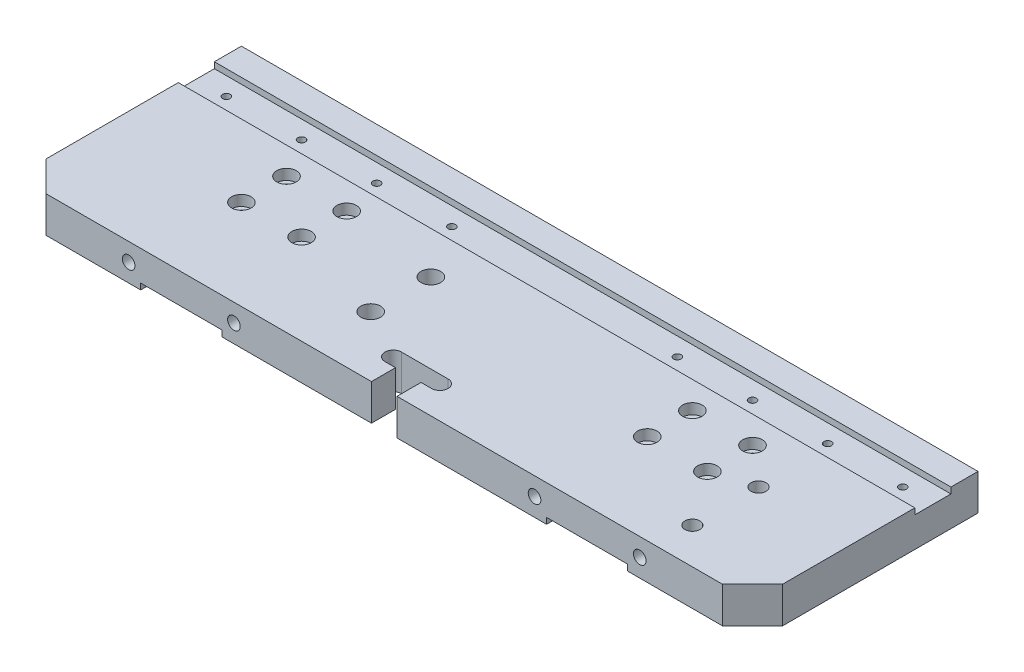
ISO-10303-21;
HEADER;
FILE_DESCRIPTION(('STEP AP214'),'2;1');
FILE_NAME('part.step','',(''),(''),'','','');
FILE_SCHEMA(('AUTOMOTIVE_DESIGN { 1 0 10303 214 1 1 1 1 }'));
ENDSEC;
DATA;
#1=APPLICATION_CONTEXT('core data for automotive mechanical design processes');
#2=APPLICATION_PROTOCOL_DEFINITION('international standard','automotive_design',2000,#1);
#3=PRODUCT_CONTEXT('',#1,'mechanical');
#4=PRODUCT('Part','Part','',(#3));
#5=PRODUCT_RELATED_PRODUCT_CATEGORY('part','',(#4));
#6=PRODUCT_DEFINITION_FORMATION('','',#4);
#7=PRODUCT_DEFINITION_CONTEXT('part definition',#1,'design');
#8=PRODUCT_DEFINITION('design','',#6,#7);
#9=PRODUCT_DEFINITION_SHAPE('','',#8);
#10=(LENGTH_UNIT() NAMED_UNIT(*) SI_UNIT(.MILLI.,.METRE.));
#11=(NAMED_UNIT(*) PLANE_ANGLE_UNIT() SI_UNIT($,.RADIAN.));
#12=(NAMED_UNIT(*) SI_UNIT($,.STERADIAN.) SOLID_ANGLE_UNIT());
#13=UNCERTAINTY_MEASURE_WITH_UNIT(LENGTH_MEASURE(1.E-05),#10,'distance_accuracy_value','');
#14=(GEOMETRIC_REPRESENTATION_CONTEXT(3) GLOBAL_UNCERTAINTY_ASSIGNED_CONTEXT((#13)) GLOBAL_UNIT_ASSIGNED_CONTEXT((#10,
#11,#12)) REPRESENTATION_CONTEXT('',''));
#15=CARTESIAN_POINT('',(0.,0.,0.));
#16=DIRECTION('',(0.,0.,1.));
#17=DIRECTION('',(1.,0.,0.));
#18=AXIS2_PLACEMENT_3D('',#15,#16,#17);
#19=CARTESIAN_POINT('',(98.,-3.,35.));
#20=DIRECTION('',(0.,1.,0.));
#21=DIRECTION('',(0.,0.,1.));
#22=AXIS2_PLACEMENT_3D('',#19,#20,#21);
#23=CYLINDRICAL_SURFACE('',#22,3.25);
#24=CARTESIAN_POINT('',(98.,12.,35.));
#25=DIRECTION('',(0.,1.,0.));
#26=DIRECTION('',(0.,0.,1.));
#27=AXIS2_PLACEMENT_3D('',#24,#25,#26);
#28=CIRCLE('',#27,3.25);
#29=CARTESIAN_POINT('',(98.,12.,38.25));
#30=VERTEX_POINT('',#29);
#31=EDGE_CURVE('E279',#30,#30,#28,.T.);
#32=ORIENTED_EDGE('',*,*,#31,.T.);
#33=EDGE_LOOP('',(#32));
#34=FACE_BOUND('',#33,.T.);
#35=CARTESIAN_POINT('',(98.,3.5,35.));
#36=DIRECTION('',(0.,-1.,0.));
#37=DIRECTION('',(0.,0.,-1.));
#38=AXIS2_PLACEMENT_3D('',#35,#36,#37);
#39=CIRCLE('',#38,3.25);
#40=CARTESIAN_POINT('',(98.,3.5,31.75));
#41=VERTEX_POINT('',#40);
#42=EDGE_CURVE('E37',#41,#41,#39,.F.);
#43=ORIENTED_EDGE('',*,*,#42,.F.);
#44=EDGE_LOOP('',(#43));
#45=FACE_BOUND('',#44,.T.);
#46=ADVANCED_FACE('F33',(#34,#45),#23,.F.);
#47=CARTESIAN_POINT('',(98.,-3.,55.));
#48=DIRECTION('',(0.,1.,0.));
#49=DIRECTION('',(0.,0.,1.));
#50=AXIS2_PLACEMENT_3D('',#47,#48,#49);
#51=CYLINDRICAL_SURFACE('',#50,3.25);
#52=CARTESIAN_POINT('',(98.,12.,55.));
#53=DIRECTION('',(0.,1.,0.));
#54=DIRECTION('',(0.,0.,1.));
#55=AXIS2_PLACEMENT_3D('',#52,#53,#54);
#56=CIRCLE('',#55,3.25);
#57=CARTESIAN_POINT('',(98.,12.,58.25));
#58=VERTEX_POINT('',#57);
#59=EDGE_CURVE('E282',#58,#58,#56,.T.);
#60=ORIENTED_EDGE('',*,*,#59,.T.);
#61=EDGE_LOOP('',(#60));
#62=FACE_BOUND('',#61,.T.);
#63=CARTESIAN_POINT('',(98.,3.5,55.));
#64=DIRECTION('',(0.,-1.,0.));
#65=DIRECTION('',(0.,0.,-1.));
#66=AXIS2_PLACEMENT_3D('',#63,#64,#65);
#67=CIRCLE('',#66,3.25);
#68=CARTESIAN_POINT('',(98.,3.5,51.75));
#69=VERTEX_POINT('',#68);
#70=EDGE_CURVE('E566',#69,#69,#67,.F.);
#71=ORIENTED_EDGE('',*,*,#70,.F.);
#72=EDGE_LOOP('',(#71));
#73=FACE_BOUND('',#72,.T.);
#74=ADVANCED_FACE('F634',(#62,#73),#51,.F.);
#75=CARTESIAN_POINT('',(180.000000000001,-3.,45.));
#76=DIRECTION('',(0.,1.,0.));
#77=DIRECTION('',(0.,0.,1.));
#78=AXIS2_PLACEMENT_3D('',#75,#76,#77);
#79=CYLINDRICAL_SURFACE('',#78,1.75);
#80=CARTESIAN_POINT('',(180.000000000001,2.,45.));
#81=DIRECTION('',(0.,1.,0.));
#82=DIRECTION('',(0.,0.,1.));
#83=AXIS2_PLACEMENT_3D('',#80,#81,#82);
#84=CIRCLE('',#83,1.75);
#85=CARTESIAN_POINT('',(180.000000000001,2.,46.75));
#86=VERTEX_POINT('',#85);
#87=EDGE_CURVE('E285',#86,#86,#84,.T.);
#88=ORIENTED_EDGE('',*,*,#87,.F.);
#89=EDGE_LOOP('',(#88));
#90=FACE_BOUND('',#89,.T.);
#91=CARTESIAN_POINT('',(180.000000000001,8.5,45.));
#92=DIRECTION('',(0.,1.,0.));
#93=DIRECTION('',(0.,0.,1.));
#94=AXIS2_PLACEMENT_3D('',#91,#92,#93);
#95=CIRCLE('',#94,1.75);
#96=CARTESIAN_POINT('',(180.000000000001,8.5,46.75));
#97=VERTEX_POINT('',#96);
#98=EDGE_CURVE('E562',#97,#97,#95,.F.);
#99=ORIENTED_EDGE('',*,*,#98,.F.);
#100=EDGE_LOOP('',(#99));
#101=FACE_BOUND('',#100,.T.);
#102=ADVANCED_FACE('F710',(#90,#101),#79,.F.);
#103=CARTESIAN_POINT('',(200.000000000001,-3.,45.));
#104=DIRECTION('',(0.,1.,0.));
#105=DIRECTION('',(0.,0.,1.));
#106=AXIS2_PLACEMENT_3D('',#103,#104,#105);
#107=CYLINDRICAL_SURFACE('',#106,1.75);
#108=CARTESIAN_POINT('',(200.000000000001,2.,45.));
#109=DIRECTION('',(0.,1.,0.));
#110=DIRECTION('',(0.,0.,1.));
#111=AXIS2_PLACEMENT_3D('',#108,#109,#110);
#112=CIRCLE('',#111,1.75);
#113=CARTESIAN_POINT('',(200.000000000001,2.,46.75));
#114=VERTEX_POINT('',#113);
#115=EDGE_CURVE('E518',#114,#114,#112,.T.);
#116=ORIENTED_EDGE('',*,*,#115,.F.);
#117=EDGE_LOOP('',(#116));
#118=FACE_BOUND('',#117,.T.);
#119=CARTESIAN_POINT('',(200.000000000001,8.5,45.));
#120=DIRECTION('',(0.,1.,0.));
#121=DIRECTION('',(0.,0.,1.));
#122=AXIS2_PLACEMENT_3D('',#119,#120,#121);
#123=CIRCLE('',#122,1.75);
#124=CARTESIAN_POINT('',(200.000000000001,8.5,46.75));
#125=VERTEX_POINT('',#124);
#126=EDGE_CURVE('E557',#125,#125,#123,.F.);
#127=ORIENTED_EDGE('',*,*,#126,.F.);
#128=EDGE_LOOP('',(#127));
#129=FACE_BOUND('',#128,.T.);
#130=ADVANCED_FACE('F714',(#118,#129),#107,.F.);
#131=CARTESIAN_POINT('',(200.000000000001,-3.,30.));
#132=DIRECTION('',(0.,1.,0.));
#133=DIRECTION('',(0.,0.,1.));
#134=AXIS2_PLACEMENT_3D('',#131,#132,#133);
#135=CYLINDRICAL_SURFACE('',#134,1.75);
#136=CARTESIAN_POINT('',(200.000000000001,2.,30.));
#137=DIRECTION('',(0.,1.,0.));
#138=DIRECTION('',(0.,0.,1.));
#139=AXIS2_PLACEMENT_3D('',#136,#137,#138);
#140=CIRCLE('',#139,1.75);
#141=CARTESIAN_POINT('',(200.000000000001,2.,31.75));
#142=VERTEX_POINT('',#141);
#143=EDGE_CURVE('E515',#142,#142,#140,.T.);
#144=ORIENTED_EDGE('',*,*,#143,.F.);
#145=EDGE_LOOP('',(#144));
#146=FACE_BOUND('',#145,.T.);
#147=CARTESIAN_POINT('',(200.000000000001,8.5,30.));
#148=DIRECTION('',(0.,1.,0.));
#149=DIRECTION('',(0.,0.,1.));
#150=AXIS2_PLACEMENT_3D('',#147,#148,#149);
#151=CIRCLE('',#150,1.75);
#152=CARTESIAN_POINT('',(200.000000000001,8.5,31.75));
#153=VERTEX_POINT('',#152);
#154=EDGE_CURVE('E552',#153,#153,#151,.F.);
#155=ORIENTED_EDGE('',*,*,#154,.F.);
#156=EDGE_LOOP('',(#155));
#157=FACE_BOUND('',#156,.T.);
#158=ADVANCED_FACE('F718',(#146,#157),#135,.F.);
#159=CARTESIAN_POINT('',(180.000000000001,-3.,30.));
#160=DIRECTION('',(0.,1.,0.));
#161=DIRECTION('',(0.,0.,1.));
#162=AXIS2_PLACEMENT_3D('',#159,#160,#161);
#163=CYLINDRICAL_SURFACE('',#162,1.75);
#164=CARTESIAN_POINT('',(180.000000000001,2.,30.));
#165=DIRECTION('',(0.,1.,0.));
#166=DIRECTION('',(0.,0.,1.));
#167=AXIS2_PLACEMENT_3D('',#164,#165,#166);
#168=CIRCLE('',#167,1.75);
#169=CARTESIAN_POINT('',(180.000000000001,2.,31.75));
#170=VERTEX_POINT('',#169);
#171=EDGE_CURVE('E512',#170,#170,#168,.T.);
#172=ORIENTED_EDGE('',*,*,#171,.F.);
#173=EDGE_LOOP('',(#172));
#174=FACE_BOUND('',#173,.T.);
#175=CARTESIAN_POINT('',(180.000000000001,8.5,30.));
#176=DIRECTION('',(0.,1.,0.));
#177=DIRECTION('',(0.,0.,1.));
#178=AXIS2_PLACEMENT_3D('',#175,#176,#177);
#179=CIRCLE('',#178,1.75);
#180=CARTESIAN_POINT('',(180.000000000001,8.5,31.75));
#181=VERTEX_POINT('',#180);
#182=EDGE_CURVE('E547',#181,#181,#179,.F.);
#183=ORIENTED_EDGE('',*,*,#182,.F.);
#184=EDGE_LOOP('',(#183));
#185=FACE_BOUND('',#184,.T.);
#186=ADVANCED_FACE('F722',(#174,#185),#163,.F.);
#187=CARTESIAN_POINT('',(45.0000000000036,-3.,45.));
#188=DIRECTION('',(0.,1.,0.));
#189=DIRECTION('',(0.,0.,1.));
#190=AXIS2_PLACEMENT_3D('',#187,#188,#189);
#191=CYLINDRICAL_SURFACE('',#190,1.75);
#192=CARTESIAN_POINT('',(45.0000000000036,2.,45.));
#193=DIRECTION('',(0.,1.,0.));
#194=DIRECTION('',(0.,0.,1.));
#195=AXIS2_PLACEMENT_3D('',#192,#193,#194);
#196=CIRCLE('',#195,1.75);
#197=CARTESIAN_POINT('',(45.0000000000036,2.,46.75));
#198=VERTEX_POINT('',#197);
#199=EDGE_CURVE('E509',#198,#198,#196,.T.);
#200=ORIENTED_EDGE('',*,*,#199,.F.);
#201=EDGE_LOOP('',(#200));
#202=FACE_BOUND('',#201,.T.);
#203=CARTESIAN_POINT('',(45.0000000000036,8.5,45.));
#204=DIRECTION('',(0.,1.,0.));
#205=DIRECTION('',(0.,0.,1.));
#206=AXIS2_PLACEMENT_3D('',#203,#204,#205);
#207=CIRCLE('',#206,1.75);
#208=CARTESIAN_POINT('',(45.0000000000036,8.5,46.75));
#209=VERTEX_POINT('',#208);
#210=EDGE_CURVE('E542',#209,#209,#207,.F.);
#211=ORIENTED_EDGE('',*,*,#210,.F.);
#212=EDGE_LOOP('',(#211));
#213=FACE_BOUND('',#212,.T.);
#214=ADVANCED_FACE('F726',(#202,#213),#191,.F.);
#215=CARTESIAN_POINT('',(65.0000000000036,-3.,45.));
#216=DIRECTION('',(0.,1.,0.));
#217=DIRECTION('',(0.,0.,1.));
#218=AXIS2_PLACEMENT_3D('',#215,#216,#217);
#219=CYLINDRICAL_SURFACE('',#218,1.75);
#220=CARTESIAN_POINT('',(65.0000000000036,2.,45.));
#221=DIRECTION('',(0.,1.,0.));
#222=DIRECTION('',(0.,0.,1.));
#223=AXIS2_PLACEMENT_3D('',#220,#221,#222);
#224=CIRCLE('',#223,1.75);
#225=CARTESIAN_POINT('',(65.0000000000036,2.,46.75));
#226=VERTEX_POINT('',#225);
#227=EDGE_CURVE('E506',#226,#226,#224,.T.);
#228=ORIENTED_EDGE('',*,*,#227,.F.);
#229=EDGE_LOOP('',(#228));
#230=FACE_BOUND('',#229,.T.);
#231=CARTESIAN_POINT('',(65.0000000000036,8.5,45.));
#232=DIRECTION('',(0.,1.,0.));
#233=DIRECTION('',(0.,0.,1.));
#234=AXIS2_PLACEMENT_3D('',#231,#232,#233);
#235=CIRCLE('',#234,1.75);
#236=CARTESIAN_POINT('',(65.0000000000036,8.5,46.75));
#237=VERTEX_POINT('',#236);
#238=EDGE_CURVE('E537',#237,#237,#235,.F.);
#239=ORIENTED_EDGE('',*,*,#238,.F.);
#240=EDGE_LOOP('',(#239));
#241=FACE_BOUND('',#240,.T.);
#242=ADVANCED_FACE('F730',(#230,#241),#219,.F.);
#243=CARTESIAN_POINT('',(65.0000000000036,-3.,30.));
#244=DIRECTION('',(0.,1.,0.));
#245=DIRECTION('',(0.,0.,1.));
#246=AXIS2_PLACEMENT_3D('',#243,#244,#245);
#247=CYLINDRICAL_SURFACE('',#246,1.75);
#248=CARTESIAN_POINT('',(65.0000000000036,2.,30.));
#249=DIRECTION('',(0.,1.,0.));
#250=DIRECTION('',(0.,0.,1.));
#251=AXIS2_PLACEMENT_3D('',#248,#249,#250);
#252=CIRCLE('',#251,1.75);
#253=CARTESIAN_POINT('',(65.0000000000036,2.,31.75));
#254=VERTEX_POINT('',#253);
#255=EDGE_CURVE('E503',#254,#254,#252,.T.);
#256=ORIENTED_EDGE('',*,*,#255,.F.);
#257=EDGE_LOOP('',(#256));
#258=FACE_BOUND('',#257,.T.);
#259=CARTESIAN_POINT('',(65.0000000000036,8.5,30.));
#260=DIRECTION('',(0.,1.,0.));
#261=DIRECTION('',(0.,0.,1.));
#262=AXIS2_PLACEMENT_3D('',#259,#260,#261);
#263=CIRCLE('',#262,1.75);
#264=CARTESIAN_POINT('',(65.0000000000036,8.5,31.75));
#265=VERTEX_POINT('',#264);
#266=EDGE_CURVE('E532',#265,#265,#263,.F.);
#267=ORIENTED_EDGE('',*,*,#266,.F.);
#268=EDGE_LOOP('',(#267));
#269=FACE_BOUND('',#268,.T.);
#270=ADVANCED_FACE('F734',(#258,#269),#247,.F.);
#271=CARTESIAN_POINT('',(45.0000000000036,-3.,30.));
#272=DIRECTION('',(0.,1.,0.));
#273=DIRECTION('',(0.,0.,1.));
#274=AXIS2_PLACEMENT_3D('',#271,#272,#273);
#275=CYLINDRICAL_SURFACE('',#274,1.75);
#276=CARTESIAN_POINT('',(45.0000000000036,2.,30.));
#277=DIRECTION('',(0.,1.,0.));
#278=DIRECTION('',(0.,0.,1.));
#279=AXIS2_PLACEMENT_3D('',#276,#277,#278);
#280=CIRCLE('',#279,1.75);
#281=CARTESIAN_POINT('',(45.0000000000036,2.,31.75));
#282=VERTEX_POINT('',#281);
#283=EDGE_CURVE('E290',#282,#282,#280,.T.);
#284=ORIENTED_EDGE('',*,*,#283,.F.);
#285=EDGE_LOOP('',(#284));
#286=FACE_BOUND('',#285,.T.);
#287=CARTESIAN_POINT('',(45.0000000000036,8.5,30.));
#288=DIRECTION('',(0.,1.,0.));
#289=DIRECTION('',(0.,0.,1.));
#290=AXIS2_PLACEMENT_3D('',#287,#288,#289);
#291=CIRCLE('',#290,1.75);
#292=CARTESIAN_POINT('',(45.0000000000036,8.5,31.75));
#293=VERTEX_POINT('',#292);
#294=EDGE_CURVE('E231',#293,#293,#291,.F.);
#295=ORIENTED_EDGE('',*,*,#294,.F.);
#296=EDGE_LOOP('',(#295));
#297=FACE_BOUND('',#296,.T.);
#298=ADVANCED_FACE('F738',(#286,#297),#275,.F.);
#299=CARTESIAN_POINT('',(245.000000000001,0.,75.));
#300=DIRECTION('',(-1.,0.,0.));
#301=DIRECTION('',(0.,0.,1.));
#302=AXIS2_PLACEMENT_3D('',#299,#300,#301);
#303=PLANE('',#302);
#304=DIRECTION('',(0.,1.,0.));
#305=VECTOR('',#304,1.);
#306=CARTESIAN_POINT('',(245.000000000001,-3.,65.));
#307=LINE('',#306,#305);
#308=CARTESIAN_POINT('',(245.000000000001,0.,65.));
#309=VERTEX_POINT('',#308);
#310=CARTESIAN_POINT('',(245.000000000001,12.,65.));
#311=VERTEX_POINT('',#310);
#312=EDGE_CURVE('E255',#309,#311,#307,.T.);
#313=ORIENTED_EDGE('',*,*,#312,.F.);
#314=DIRECTION('',(0.,0.,-1.));
#315=VECTOR('',#314,1.);
#316=CARTESIAN_POINT('',(245.000000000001,0.,75.));
#317=LINE('',#316,#315);
#318=CARTESIAN_POINT('',(245.000000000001,0.,0.));
#319=VERTEX_POINT('',#318);
#320=EDGE_CURVE('E463',#309,#319,#317,.T.);
#321=ORIENTED_EDGE('',*,*,#320,.T.);
#322=DIRECTION('',(0.,1.,0.));
#323=VECTOR('',#322,1.);
#324=CARTESIAN_POINT('',(245.000000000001,0.,0.));
#325=LINE('',#324,#323);
#326=CARTESIAN_POINT('',(245.000000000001,12.,0.));
#327=VERTEX_POINT('',#326);
#328=EDGE_CURVE('E418',#319,#327,#325,.T.);
#329=ORIENTED_EDGE('',*,*,#328,.T.);
#330=DIRECTION('',(0.,0.,-1.));
#331=VECTOR('',#330,1.);
#332=CARTESIAN_POINT('',(245.000000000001,12.,75.));
#333=LINE('',#332,#331);
#334=CARTESIAN_POINT('',(245.000000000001,12.,8.99999999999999));
#335=VERTEX_POINT('',#334);
#336=EDGE_CURVE('E460',#335,#327,#333,.T.);
#337=ORIENTED_EDGE('',*,*,#336,.F.);
#338=DIRECTION('',(0.,1.,0.));
#339=VECTOR('',#338,1.);
#340=CARTESIAN_POINT('',(245.000000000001,0.,8.99999999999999));
#341=LINE('',#340,#339);
#342=CARTESIAN_POINT('',(245.000000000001,10.,8.99999999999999));
#343=VERTEX_POINT('',#342);
#344=EDGE_CURVE('E349',#343,#335,#341,.T.);
#345=ORIENTED_EDGE('',*,*,#344,.F.);
#346=DIRECTION('',(0.,0.,-1.));
#347=VECTOR('',#346,1.);
#348=CARTESIAN_POINT('',(245.000000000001,10.,75.));
#349=LINE('',#348,#347);
#350=CARTESIAN_POINT('',(245.000000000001,10.,21.));
#351=VERTEX_POINT('',#350);
#352=EDGE_CURVE('E354',#351,#343,#349,.T.);
#353=ORIENTED_EDGE('',*,*,#352,.F.);
#354=DIRECTION('',(0.,-1.,0.));
#355=VECTOR('',#354,1.);
#356=CARTESIAN_POINT('',(245.000000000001,0.,21.));
#357=LINE('',#356,#355);
#358=CARTESIAN_POINT('',(245.000000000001,12.,21.));
#359=VERTEX_POINT('',#358);
#360=EDGE_CURVE('E357',#359,#351,#357,.T.);
#361=ORIENTED_EDGE('',*,*,#360,.F.);
#362=EDGE_CURVE('E461',#311,#359,#333,.T.);
#363=ORIENTED_EDGE('',*,*,#362,.F.);
#364=EDGE_LOOP('',(#313,#321,#329,#337,#345,#353,#361,#363));
#365=FACE_BOUND('',#364,.T.);
#366=ADVANCED_FACE('F620',(#365),#303,.F.);
#367=CARTESIAN_POINT('',(0.,12.,75.));
#368=DIRECTION('',(0.,-1.,0.));
#369=DIRECTION('',(0.,0.,-1.));
#370=AXIS2_PLACEMENT_3D('',#367,#368,#369);
#371=PLANE('',#370);
#372=CARTESIAN_POINT('',(180.000000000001,12.,45.));
#373=DIRECTION('',(0.,1.,0.));
#374=DIRECTION('',(0.,0.,1.));
#375=AXIS2_PLACEMENT_3D('',#372,#373,#374);
#376=CIRCLE('',#375,3.25);
#377=CARTESIAN_POINT('',(180.000000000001,12.,48.25));
#378=VERTEX_POINT('',#377);
#379=EDGE_CURVE('E568',#378,#378,#376,.T.);
#380=ORIENTED_EDGE('',*,*,#379,.F.);
#381=EDGE_LOOP('',(#380));
#382=FACE_BOUND('',#381,.T.);
#383=CARTESIAN_POINT('',(200.000000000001,12.,45.));
#384=DIRECTION('',(0.,1.,0.));
#385=DIRECTION('',(0.,0.,1.));
#386=AXIS2_PLACEMENT_3D('',#383,#384,#385);
#387=CIRCLE('',#386,3.25);
#388=CARTESIAN_POINT('',(200.000000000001,12.,48.25));
#389=VERTEX_POINT('',#388);
#390=EDGE_CURVE('E564',#389,#389,#387,.T.);
#391=ORIENTED_EDGE('',*,*,#390,.F.);
#392=EDGE_LOOP('',(#391));
#393=FACE_BOUND('',#392,.T.);
#394=CARTESIAN_POINT('',(200.000000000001,12.,30.));
#395=DIRECTION('',(0.,1.,0.));
#396=DIRECTION('',(0.,0.,1.));
#397=AXIS2_PLACEMENT_3D('',#394,#395,#396);
#398=CIRCLE('',#397,3.25);
#399=CARTESIAN_POINT('',(200.000000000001,12.,33.25));
#400=VERTEX_POINT('',#399);
#401=EDGE_CURVE('E560',#400,#400,#398,.T.);
#402=ORIENTED_EDGE('',*,*,#401,.F.);
#403=EDGE_LOOP('',(#402));
#404=FACE_BOUND('',#403,.T.);
#405=CARTESIAN_POINT('',(180.000000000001,12.,30.));
#406=DIRECTION('',(0.,1.,0.));
#407=DIRECTION('',(0.,0.,1.));
#408=AXIS2_PLACEMENT_3D('',#405,#406,#407);
#409=CIRCLE('',#408,3.25);
#410=CARTESIAN_POINT('',(180.000000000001,12.,33.25));
#411=VERTEX_POINT('',#410);
#412=EDGE_CURVE('E555',#411,#411,#409,.T.);
#413=ORIENTED_EDGE('',*,*,#412,.F.);
#414=EDGE_LOOP('',(#413));
#415=FACE_BOUND('',#414,.T.);
#416=CARTESIAN_POINT('',(45.0000000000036,12.,45.));
#417=DIRECTION('',(0.,1.,0.));
#418=DIRECTION('',(0.,0.,1.));
#419=AXIS2_PLACEMENT_3D('',#416,#417,#418);
#420=CIRCLE('',#419,3.25);
#421=CARTESIAN_POINT('',(45.0000000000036,12.,48.25));
#422=VERTEX_POINT('',#421);
#423=EDGE_CURVE('E550',#422,#422,#420,.T.);
#424=ORIENTED_EDGE('',*,*,#423,.F.);
#425=EDGE_LOOP('',(#424));
#426=FACE_BOUND('',#425,.T.);
#427=CARTESIAN_POINT('',(65.0000000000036,12.,45.));
#428=DIRECTION('',(0.,1.,0.));
#429=DIRECTION('',(0.,0.,1.));
#430=AXIS2_PLACEMENT_3D('',#427,#428,#429);
#431=CIRCLE('',#430,3.25);
#432=CARTESIAN_POINT('',(65.0000000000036,12.,48.25));
#433=VERTEX_POINT('',#432);
#434=EDGE_CURVE('E545',#433,#433,#431,.T.);
#435=ORIENTED_EDGE('',*,*,#434,.F.);
#436=EDGE_LOOP('',(#435));
#437=FACE_BOUND('',#436,.T.);
#438=CARTESIAN_POINT('',(65.0000000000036,12.,30.));
#439=DIRECTION('',(0.,1.,0.));
#440=DIRECTION('',(0.,0.,1.));
#441=AXIS2_PLACEMENT_3D('',#438,#439,#440);
#442=CIRCLE('',#441,3.25);
#443=CARTESIAN_POINT('',(65.0000000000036,12.,33.25));
#444=VERTEX_POINT('',#443);
#445=EDGE_CURVE('E540',#444,#444,#442,.T.);
#446=ORIENTED_EDGE('',*,*,#445,.F.);
#447=EDGE_LOOP('',(#446));
#448=FACE_BOUND('',#447,.T.);
#449=CARTESIAN_POINT('',(45.0000000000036,12.,30.));
#450=DIRECTION('',(0.,1.,0.));
#451=DIRECTION('',(0.,0.,1.));
#452=AXIS2_PLACEMENT_3D('',#449,#450,#451);
#453=CIRCLE('',#452,3.25);
#454=CARTESIAN_POINT('',(45.0000000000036,12.,33.25));
#455=VERTEX_POINT('',#454);
#456=EDGE_CURVE('E535',#455,#455,#453,.T.);
#457=ORIENTED_EDGE('',*,*,#456,.F.);
#458=EDGE_LOOP('',(#457));
#459=FACE_BOUND('',#458,.T.);
#460=CARTESIAN_POINT('',(213.000000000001,12.,41.));
#461=DIRECTION('',(0.,1.,0.));
#462=DIRECTION('',(0.,0.,1.));
#463=AXIS2_PLACEMENT_3D('',#460,#461,#462);
#464=CIRCLE('',#463,2.5);
#465=CARTESIAN_POINT('',(213.000000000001,12.,43.5));
#466=VERTEX_POINT('',#465);
#467=EDGE_CURVE('E291',#466,#466,#464,.T.);
#468=ORIENTED_EDGE('',*,*,#467,.F.);
#469=EDGE_LOOP('',(#468));
#470=FACE_BOUND('',#469,.T.);
#471=CARTESIAN_POINT('',(213.000000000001,12.,63.));
#472=DIRECTION('',(0.,1.,0.));
#473=DIRECTION('',(0.,0.,1.));
#474=AXIS2_PLACEMENT_3D('',#471,#472,#473);
#475=CIRCLE('',#474,2.5);
#476=CARTESIAN_POINT('',(213.000000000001,12.,65.5));
#477=VERTEX_POINT('',#476);
#478=EDGE_CURVE('E286',#477,#477,#475,.T.);
#479=ORIENTED_EDGE('',*,*,#478,.F.);
#480=EDGE_LOOP('',(#479));
#481=FACE_BOUND('',#480,.T.);
#482=ORIENTED_EDGE('',*,*,#59,.F.);
#483=EDGE_LOOP('',(#482));
#484=FACE_BOUND('',#483,.T.);
#485=ORIENTED_EDGE('',*,*,#31,.F.);
#486=EDGE_LOOP('',(#485));
#487=FACE_BOUND('',#486,.T.);
#488=DIRECTION('',(0.707106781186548,0.,0.707106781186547));
#489=VECTOR('',#488,1.);
#490=CARTESIAN_POINT('',(10.,12.,75.));
#491=LINE('',#490,#489);
#492=CARTESIAN_POINT('',(0.,12.,65.));
#493=VERTEX_POINT('',#492);
#494=CARTESIAN_POINT('',(9.99999999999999,12.,75.));
#495=VERTEX_POINT('',#494);
#496=EDGE_CURVE('E229',#493,#495,#491,.T.);
#497=ORIENTED_EDGE('',*,*,#496,.T.);
#498=DIRECTION('',(-1.,0.,0.));
#499=VECTOR('',#498,1.);
#500=CARTESIAN_POINT('',(0.,12.,75.));
#501=LINE('',#500,#499);
#502=CARTESIAN_POINT('',(118.25,12.,75.));
#503=VERTEX_POINT('',#502);
#504=EDGE_CURVE('E228',#503,#495,#501,.T.);
#505=ORIENTED_EDGE('',*,*,#504,.F.);
#506=DIRECTION('',(0.,0.,-1.));
#507=VECTOR('',#506,1.);
#508=CARTESIAN_POINT('',(118.25,12.,67.));
#509=LINE('',#508,#507);
#510=CARTESIAN_POINT('',(118.25,12.,67.));
#511=VERTEX_POINT('',#510);
#512=EDGE_CURVE('E58',#503,#511,#509,.T.);
#513=ORIENTED_EDGE('',*,*,#512,.T.);
#514=DIRECTION('',(-1.,0.,0.));
#515=VECTOR('',#514,1.);
#516=CARTESIAN_POINT('',(114.75,12.,67.));
#517=LINE('',#516,#515);
#518=CARTESIAN_POINT('',(114.75,12.,67.));
#519=VERTEX_POINT('',#518);
#520=EDGE_CURVE('E216',#511,#519,#517,.T.);
#521=ORIENTED_EDGE('',*,*,#520,.T.);
#522=CARTESIAN_POINT('',(114.75,12.,64.25));
#523=DIRECTION('',(0.,-1.,0.));
#524=DIRECTION('',(0.,0.,1.));
#525=AXIS2_PLACEMENT_3D('',#522,#523,#524);
#526=CIRCLE('',#525,2.75);
#527=CARTESIAN_POINT('',(114.75,12.,61.5));
#528=VERTEX_POINT('',#527);
#529=EDGE_CURVE('E222',#519,#528,#526,.T.);
#530=ORIENTED_EDGE('',*,*,#529,.T.);
#531=DIRECTION('',(1.,0.,0.));
#532=VECTOR('',#531,1.);
#533=CARTESIAN_POINT('',(114.75,12.,61.5));
#534=LINE('',#533,#532);
#535=CARTESIAN_POINT('',(130.25,12.,61.5));
#536=VERTEX_POINT('',#535);
#537=EDGE_CURVE('E236',#528,#536,#534,.T.);
#538=ORIENTED_EDGE('',*,*,#537,.T.);
#539=CARTESIAN_POINT('',(130.25,12.,64.25));
#540=DIRECTION('',(0.,-1.,0.));
#541=DIRECTION('',(0.,0.,1.));
#542=AXIS2_PLACEMENT_3D('',#539,#540,#541);
#543=CIRCLE('',#542,2.75);
#544=CARTESIAN_POINT('',(130.25,12.,67.));
#545=VERTEX_POINT('',#544);
#546=EDGE_CURVE('E239',#536,#545,#543,.T.);
#547=ORIENTED_EDGE('',*,*,#546,.T.);
#548=DIRECTION('',(-1.,0.,0.));
#549=VECTOR('',#548,1.);
#550=CARTESIAN_POINT('',(126.75,12.,67.));
#551=LINE('',#550,#549);
#552=CARTESIAN_POINT('',(126.75,12.,67.));
#553=VERTEX_POINT('',#552);
#554=EDGE_CURVE('E242',#545,#553,#551,.T.);
#555=ORIENTED_EDGE('',*,*,#554,.T.);
#556=DIRECTION('',(0.,0.,1.));
#557=VECTOR('',#556,1.);
#558=CARTESIAN_POINT('',(126.75,12.,67.));
#559=LINE('',#558,#557);
#560=CARTESIAN_POINT('',(126.75,12.,75.));
#561=VERTEX_POINT('',#560);
#562=EDGE_CURVE('E245',#553,#561,#559,.T.);
#563=ORIENTED_EDGE('',*,*,#562,.T.);
#564=CARTESIAN_POINT('',(235.000000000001,12.,75.));
#565=VERTEX_POINT('',#564);
#566=EDGE_CURVE('E395',#565,#561,#501,.T.);
#567=ORIENTED_EDGE('',*,*,#566,.F.);
#568=DIRECTION('',(0.707106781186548,0.,-0.707106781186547));
#569=VECTOR('',#568,1.);
#570=CARTESIAN_POINT('',(235.000000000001,12.,75.));
#571=LINE('',#570,#569);
#572=EDGE_CURVE('E248',#565,#311,#571,.T.);
#573=ORIENTED_EDGE('',*,*,#572,.T.);
#574=ORIENTED_EDGE('',*,*,#362,.T.);
#575=DIRECTION('',(-1.,0.,0.));
#576=VECTOR('',#575,1.);
#577=CARTESIAN_POINT('',(617.504264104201,12.,21.));
#578=LINE('',#577,#576);
#579=CARTESIAN_POINT('',(0.,12.,21.));
#580=VERTEX_POINT('',#579);
#581=EDGE_CURVE('E346',#359,#580,#578,.T.);
#582=ORIENTED_EDGE('',*,*,#581,.T.);
#583=DIRECTION('',(0.,0.,-1.));
#584=VECTOR('',#583,1.);
#585=CARTESIAN_POINT('',(0.,12.,75.));
#586=LINE('',#585,#584);
#587=EDGE_CURVE('E458',#493,#580,#586,.T.);
#588=ORIENTED_EDGE('',*,*,#587,.F.);
#589=EDGE_LOOP('',(#497,#505,#513,#521,#530,#538,#547,#555,#563,#567,#573,#574,#582,#588));
#590=FACE_BOUND('',#589,.T.);
#591=ADVANCED_FACE('F226',(#382,#393,#404,#415,#426,#437,#448,#459,#470,#481,#484,#487,#590),
#371,.F.);
#592=CARTESIAN_POINT('',(0.,0.,75.));
#593=DIRECTION('',(1.,0.,0.));
#594=DIRECTION('',(0.,0.,-1.));
#595=AXIS2_PLACEMENT_3D('',#592,#593,#594);
#596=PLANE('',#595);
#597=CARTESIAN_POINT('',(0.,6.,38.));
#598=DIRECTION('',(-1.,0.,0.));
#599=DIRECTION('',(0.,0.,1.));
#600=AXIS2_PLACEMENT_3D('',#597,#598,#599);
#601=CIRCLE('',#600,2.5);
#602=CARTESIAN_POINT('',(0.,6.,40.5));
#603=VERTEX_POINT('',#602);
#604=EDGE_CURVE('E331',#603,#603,#601,.T.);
#605=ORIENTED_EDGE('',*,*,#604,.F.);
#606=EDGE_LOOP('',(#605));
#607=FACE_BOUND('',#606,.T.);
#608=CARTESIAN_POINT('',(0.,5.99999999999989,51.9999999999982));
#609=DIRECTION('',(-1.,0.,0.));
#610=DIRECTION('',(0.,0.,1.));
#611=AXIS2_PLACEMENT_3D('',#608,#609,#610);
#612=CIRCLE('',#611,2.50000000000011);
#613=CARTESIAN_POINT('',(0.,5.99999999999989,54.4999999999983));
#614=VERTEX_POINT('',#613);
#615=EDGE_CURVE('E327',#614,#614,#612,.T.);
#616=ORIENTED_EDGE('',*,*,#615,.F.);
#617=EDGE_LOOP('',(#616));
#618=FACE_BOUND('',#617,.T.);
#619=DIRECTION('',(0.,1.,0.));
#620=VECTOR('',#619,1.);
#621=CARTESIAN_POINT('',(0.,-3.,65.));
#622=LINE('',#621,#620);
#623=CARTESIAN_POINT('',(0.,0.,65.));
#624=VERTEX_POINT('',#623);
#625=EDGE_CURVE('E252',#624,#493,#622,.T.);
#626=ORIENTED_EDGE('',*,*,#625,.T.);
#627=ORIENTED_EDGE('',*,*,#587,.T.);
#628=DIRECTION('',(0.,1.,0.));
#629=VECTOR('',#628,1.);
#630=CARTESIAN_POINT('',(0.,0.,21.));
#631=LINE('',#630,#629);
#632=CARTESIAN_POINT('',(0.,10.,21.));
#633=VERTEX_POINT('',#632);
#634=EDGE_CURVE('E477',#633,#580,#631,.T.);
#635=ORIENTED_EDGE('',*,*,#634,.F.);
#636=DIRECTION('',(0.,0.,1.));
#637=VECTOR('',#636,1.);
#638=CARTESIAN_POINT('',(0.,10.,75.));
#639=LINE('',#638,#637);
#640=CARTESIAN_POINT('',(0.,10.,9.));
#641=VERTEX_POINT('',#640);
#642=EDGE_CURVE('E474',#641,#633,#639,.T.);
#643=ORIENTED_EDGE('',*,*,#642,.F.);
#644=DIRECTION('',(0.,-1.,0.));
#645=VECTOR('',#644,1.);
#646=CARTESIAN_POINT('',(0.,0.,8.99999999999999));
#647=LINE('',#646,#645);
#648=CARTESIAN_POINT('',(0.,12.,8.99999999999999));
#649=VERTEX_POINT('',#648);
#650=EDGE_CURVE('E471',#649,#641,#647,.T.);
#651=ORIENTED_EDGE('',*,*,#650,.F.);
#652=CARTESIAN_POINT('',(0.,12.,0.));
#653=VERTEX_POINT('',#652);
#654=EDGE_CURVE('E457',#649,#653,#586,.T.);
#655=ORIENTED_EDGE('',*,*,#654,.T.);
#656=DIRECTION('',(0.,-1.,0.));
#657=VECTOR('',#656,1.);
#658=CARTESIAN_POINT('',(0.,0.,0.));
#659=LINE('',#658,#657);
#660=CARTESIAN_POINT('',(0.,0.,0.));
#661=VERTEX_POINT('',#660);
#662=EDGE_CURVE('E424',#653,#661,#659,.T.);
#663=ORIENTED_EDGE('',*,*,#662,.T.);
#664=DIRECTION('',(0.,0.,-1.));
#665=VECTOR('',#664,1.);
#666=CARTESIAN_POINT('',(0.,0.,75.));
#667=LINE('',#666,#665);
#668=EDGE_CURVE('E455',#624,#661,#667,.T.);
#669=ORIENTED_EDGE('',*,*,#668,.F.);
#670=EDGE_LOOP('',(#626,#627,#635,#643,#651,#655,#663,#669));
#671=FACE_BOUND('',#670,.T.);
#672=ADVANCED_FACE('F619',(#607,#618,#671),#596,.F.);
#673=CARTESIAN_POINT('',(203.500000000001,0.,75.));
#674=DIRECTION('',(0.,1.,0.));
#675=DIRECTION('',(0.,0.,1.));
#676=AXIS2_PLACEMENT_3D('',#673,#674,#675);
#677=PLANE('',#676);
#678=CARTESIAN_POINT('',(210.000000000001,0.,15.));
#679=DIRECTION('',(0.,1.,0.));
#680=DIRECTION('',(0.,0.,1.));
#681=AXIS2_PLACEMENT_3D('',#678,#679,#680);
#682=CIRCLE('',#681,1.25);
#683=CARTESIAN_POINT('',(210.000000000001,0.,16.25));
#684=VERTEX_POINT('',#683);
#685=EDGE_CURVE('E300',#684,#684,#682,.T.);
#686=ORIENTED_EDGE('',*,*,#685,.T.);
#687=EDGE_LOOP('',(#686));
#688=FACE_BOUND('',#687,.T.);
#689=CARTESIAN_POINT('',(235.000000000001,0.,15.));
#690=DIRECTION('',(0.,1.,0.));
#691=DIRECTION('',(0.,0.,1.));
#692=AXIS2_PLACEMENT_3D('',#689,#690,#691);
#693=CIRCLE('',#692,1.25);
#694=CARTESIAN_POINT('',(235.000000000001,0.,16.25));
#695=VERTEX_POINT('',#694);
#696=EDGE_CURVE('E295',#695,#695,#693,.T.);
#697=ORIENTED_EDGE('',*,*,#696,.T.);
#698=EDGE_LOOP('',(#697));
#699=FACE_BOUND('',#698,.T.);
#700=CARTESIAN_POINT('',(213.000000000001,0.,41.));
#701=DIRECTION('',(0.,1.,0.));
#702=DIRECTION('',(0.,0.,1.));
#703=AXIS2_PLACEMENT_3D('',#700,#701,#702);
#704=CIRCLE('',#703,2.5);
#705=CARTESIAN_POINT('',(213.000000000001,0.,43.5));
#706=VERTEX_POINT('',#705);
#707=EDGE_CURVE('E294',#706,#706,#704,.T.);
#708=ORIENTED_EDGE('',*,*,#707,.T.);
#709=EDGE_LOOP('',(#708));
#710=FACE_BOUND('',#709,.T.);
#711=CARTESIAN_POINT('',(213.000000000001,0.,63.));
#712=DIRECTION('',(0.,1.,0.));
#713=DIRECTION('',(0.,0.,1.));
#714=AXIS2_PLACEMENT_3D('',#711,#712,#713);
#715=CIRCLE('',#714,2.5);
#716=CARTESIAN_POINT('',(213.000000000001,0.,65.5));
#717=VERTEX_POINT('',#716);
#718=EDGE_CURVE('E289',#717,#717,#715,.T.);
#719=ORIENTED_EDGE('',*,*,#718,.T.);
#720=EDGE_LOOP('',(#719));
#721=FACE_BOUND('',#720,.T.);
#722=DIRECTION('',(0.707106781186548,0.,-0.707106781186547));
#723=VECTOR('',#722,1.);
#724=CARTESIAN_POINT('',(219.250000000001,0.,90.75));
#725=LINE('',#724,#723);
#726=CARTESIAN_POINT('',(235.000000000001,-1.13624387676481E-13,75.));
#727=VERTEX_POINT('',#726);
#728=EDGE_CURVE('E276',#727,#309,#725,.T.);
#729=ORIENTED_EDGE('',*,*,#728,.F.);
#730=DIRECTION('',(1.,0.,0.));
#731=VECTOR('',#730,1.);
#732=CARTESIAN_POINT('',(203.500000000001,0.,75.));
#733=LINE('',#732,#731);
#734=CARTESIAN_POINT('',(203.500000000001,0.,75.));
#735=VERTEX_POINT('',#734);
#736=EDGE_CURVE('E391',#735,#727,#733,.T.);
#737=ORIENTED_EDGE('',*,*,#736,.F.);
#738=DIRECTION('',(0.,0.,-1.));
#739=VECTOR('',#738,1.);
#740=CARTESIAN_POINT('',(203.500000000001,0.,75.));
#741=LINE('',#740,#739);
#742=CARTESIAN_POINT('',(203.500000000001,0.,0.));
#743=VERTEX_POINT('',#742);
#744=EDGE_CURVE('E465',#735,#743,#741,.T.);
#745=ORIENTED_EDGE('',*,*,#744,.T.);
#746=DIRECTION('',(1.,0.,0.));
#747=VECTOR('',#746,1.);
#748=CARTESIAN_POINT('',(203.500000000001,0.,0.));
#749=LINE('',#748,#747);
#750=EDGE_CURVE('E415',#743,#319,#749,.T.);
#751=ORIENTED_EDGE('',*,*,#750,.T.);
#752=ORIENTED_EDGE('',*,*,#320,.F.);
#753=EDGE_LOOP('',(#729,#737,#745,#751,#752));
#754=FACE_BOUND('',#753,.T.);
#755=ADVANCED_FACE('F869',(#688,#699,#710,#721,#754),#677,.F.);
#756=CARTESIAN_POINT('',(0.,0.,75.));
#757=DIRECTION('',(0.,1.,0.));
#758=DIRECTION('',(-1.,0.,0.));
#759=AXIS2_PLACEMENT_3D('',#756,#757,#758);
#760=PLANE('',#759);
#761=CARTESIAN_POINT('',(10.,0.,15.));
#762=DIRECTION('',(0.,1.,0.));
#763=DIRECTION('',(-1.,0.,0.));
#764=AXIS2_PLACEMENT_3D('',#761,#762,#763);
#765=CIRCLE('',#764,1.25);
#766=CARTESIAN_POINT('',(8.75,0.,15.));
#767=VERTEX_POINT('',#766);
#768=EDGE_CURVE('E324',#767,#767,#765,.T.);
#769=ORIENTED_EDGE('',*,*,#768,.T.);
#770=EDGE_LOOP('',(#769));
#771=FACE_BOUND('',#770,.T.);
#772=CARTESIAN_POINT('',(35.,0.,14.9999999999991));
#773=DIRECTION('',(0.,1.,0.));
#774=DIRECTION('',(-1.,0.,0.));
#775=AXIS2_PLACEMENT_3D('',#772,#773,#774);
#776=CIRCLE('',#775,1.25);
#777=CARTESIAN_POINT('',(33.75,0.,14.9999999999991));
#778=VERTEX_POINT('',#777);
#779=EDGE_CURVE('E320',#778,#778,#776,.T.);
#780=ORIENTED_EDGE('',*,*,#779,.T.);
#781=EDGE_LOOP('',(#780));
#782=FACE_BOUND('',#781,.T.);
#783=DIRECTION('',(0.707106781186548,0.,0.707106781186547));
#784=VECTOR('',#783,1.);
#785=CARTESIAN_POINT('',(5.,0.,70.));
#786=LINE('',#785,#784);
#787=CARTESIAN_POINT('',(9.99999999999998,0.,75.));
#788=VERTEX_POINT('',#787);
#789=EDGE_CURVE('E50',#624,#788,#786,.T.);
#790=ORIENTED_EDGE('',*,*,#789,.F.);
#791=ORIENTED_EDGE('',*,*,#668,.T.);
#792=DIRECTION('',(1.,0.,0.));
#793=VECTOR('',#792,1.);
#794=CARTESIAN_POINT('',(0.,0.,0.));
#795=LINE('',#794,#793);
#796=CARTESIAN_POINT('',(41.5,-1.13686837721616E-13,0.));
#797=VERTEX_POINT('',#796);
#798=EDGE_CURVE('E427',#661,#797,#795,.T.);
#799=ORIENTED_EDGE('',*,*,#798,.T.);
#800=DIRECTION('',(0.,0.,-1.));
#801=VECTOR('',#800,1.);
#802=CARTESIAN_POINT('',(41.5,-1.13686837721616E-13,75.));
#803=LINE('',#802,#801);
#804=CARTESIAN_POINT('',(41.5,-1.13686837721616E-13,75.));
#805=VERTEX_POINT('',#804);
#806=EDGE_CURVE('E452',#805,#797,#803,.T.);
#807=ORIENTED_EDGE('',*,*,#806,.F.);
#808=DIRECTION('',(1.,0.,0.));
#809=VECTOR('',#808,1.);
#810=CARTESIAN_POINT('',(0.,0.,75.));
#811=LINE('',#810,#809);
#812=EDGE_CURVE('E396',#788,#805,#811,.T.);
#813=ORIENTED_EDGE('',*,*,#812,.F.);
#814=EDGE_LOOP('',(#790,#791,#799,#807,#813));
#815=FACE_BOUND('',#814,.T.);
#816=ADVANCED_FACE('F652',(#771,#782,#815),#760,.F.);
#817=CARTESIAN_POINT('',(68.5,0.,75.));
#818=DIRECTION('',(0.,1.,0.));
#819=DIRECTION('',(0.,0.,1.));
#820=AXIS2_PLACEMENT_3D('',#817,#818,#819);
#821=PLANE('',#820);
#822=CARTESIAN_POINT('',(98.,0.,35.));
#823=DIRECTION('',(0.,-1.,0.));
#824=DIRECTION('',(0.,0.,-1.));
#825=AXIS2_PLACEMENT_3D('',#822,#823,#824);
#826=CIRCLE('',#825,5.5);
#827=CARTESIAN_POINT('',(98.,0.,29.5));
#828=VERTEX_POINT('',#827);
#829=EDGE_CURVE('E582',#828,#828,#826,.T.);
#830=ORIENTED_EDGE('',*,*,#829,.F.);
#831=EDGE_LOOP('',(#830));
#832=FACE_BOUND('',#831,.T.);
#833=CARTESIAN_POINT('',(98.,0.,55.));
#834=DIRECTION('',(0.,-1.,0.));
#835=DIRECTION('',(0.,0.,-1.));
#836=AXIS2_PLACEMENT_3D('',#833,#834,#835);
#837=CIRCLE('',#836,5.5);
#838=CARTESIAN_POINT('',(98.,0.,49.5));
#839=VERTEX_POINT('',#838);
#840=EDGE_CURVE('E575',#839,#839,#837,.T.);
#841=ORIENTED_EDGE('',*,*,#840,.F.);
#842=EDGE_LOOP('',(#841));
#843=FACE_BOUND('',#842,.T.);
#844=CARTESIAN_POINT('',(85.,0.,14.9999999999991));
#845=DIRECTION('',(0.,1.,0.));
#846=DIRECTION('',(0.,0.,1.));
#847=AXIS2_PLACEMENT_3D('',#844,#845,#846);
#848=CIRCLE('',#847,1.25);
#849=CARTESIAN_POINT('',(85.,0.,16.2499999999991));
#850=VERTEX_POINT('',#849);
#851=EDGE_CURVE('E312',#850,#850,#848,.T.);
#852=ORIENTED_EDGE('',*,*,#851,.T.);
#853=EDGE_LOOP('',(#852));
#854=FACE_BOUND('',#853,.T.);
#855=CARTESIAN_POINT('',(160.000000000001,0.,15.));
#856=DIRECTION('',(0.,1.,0.));
#857=DIRECTION('',(0.,0.,1.));
#858=AXIS2_PLACEMENT_3D('',#855,#856,#857);
#859=CIRCLE('',#858,1.25);
#860=CARTESIAN_POINT('',(160.000000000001,0.,16.25));
#861=VERTEX_POINT('',#860);
#862=EDGE_CURVE('E308',#861,#861,#859,.T.);
#863=ORIENTED_EDGE('',*,*,#862,.T.);
#864=EDGE_LOOP('',(#863));
#865=FACE_BOUND('',#864,.T.);
#866=DIRECTION('',(0.,0.,1.));
#867=VECTOR('',#866,1.);
#868=CARTESIAN_POINT('',(126.75,0.,75.));
#869=LINE('',#868,#867);
#870=CARTESIAN_POINT('',(126.75,0.,67.));
#871=VERTEX_POINT('',#870);
#872=CARTESIAN_POINT('',(126.75,-1.13624387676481E-13,75.));
#873=VERTEX_POINT('',#872);
#874=EDGE_CURVE('E274',#871,#873,#869,.T.);
#875=ORIENTED_EDGE('',*,*,#874,.F.);
#876=DIRECTION('',(-1.,0.,0.));
#877=VECTOR('',#876,1.);
#878=CARTESIAN_POINT('',(68.5,0.,67.));
#879=LINE('',#878,#877);
#880=CARTESIAN_POINT('',(130.25,0.,67.));
#881=VERTEX_POINT('',#880);
#882=EDGE_CURVE('E12',#881,#871,#879,.T.);
#883=ORIENTED_EDGE('',*,*,#882,.F.);
#884=CARTESIAN_POINT('',(130.25,0.,64.25));
#885=DIRECTION('',(0.,1.,0.));
#886=DIRECTION('',(0.,0.,1.));
#887=AXIS2_PLACEMENT_3D('',#884,#885,#886);
#888=CIRCLE('',#887,2.75);
#889=CARTESIAN_POINT('',(130.25,0.,61.5));
#890=VERTEX_POINT('',#889);
#891=EDGE_CURVE('E42',#890,#881,#888,.F.);
#892=ORIENTED_EDGE('',*,*,#891,.F.);
#893=DIRECTION('',(1.,0.,0.));
#894=VECTOR('',#893,1.);
#895=CARTESIAN_POINT('',(68.5,0.,61.5));
#896=LINE('',#895,#894);
#897=CARTESIAN_POINT('',(114.75,0.,61.5));
#898=VERTEX_POINT('',#897);
#899=EDGE_CURVE('E526',#898,#890,#896,.T.);
#900=ORIENTED_EDGE('',*,*,#899,.F.);
#901=CARTESIAN_POINT('',(114.75,0.,64.25));
#902=DIRECTION('',(0.,1.,0.));
#903=DIRECTION('',(0.,0.,1.));
#904=AXIS2_PLACEMENT_3D('',#901,#902,#903);
#905=CIRCLE('',#904,2.75);
#906=CARTESIAN_POINT('',(114.75,0.,67.));
#907=VERTEX_POINT('',#906);
#908=EDGE_CURVE('E524',#907,#898,#905,.F.);
#909=ORIENTED_EDGE('',*,*,#908,.F.);
#910=DIRECTION('',(-1.,0.,0.));
#911=VECTOR('',#910,1.);
#912=CARTESIAN_POINT('',(68.5,0.,67.));
#913=LINE('',#912,#911);
#914=CARTESIAN_POINT('',(118.25,0.,67.));
#915=VERTEX_POINT('',#914);
#916=EDGE_CURVE('E480',#915,#907,#913,.T.);
#917=ORIENTED_EDGE('',*,*,#916,.F.);
#918=DIRECTION('',(0.,0.,-1.));
#919=VECTOR('',#918,1.);
#920=CARTESIAN_POINT('',(118.25,0.,75.));
#921=LINE('',#920,#919);
#922=CARTESIAN_POINT('',(118.25,-1.13624387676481E-13,75.));
#923=VERTEX_POINT('',#922);
#924=EDGE_CURVE('E209',#923,#915,#921,.T.);
#925=ORIENTED_EDGE('',*,*,#924,.F.);
#926=DIRECTION('',(1.,0.,0.));
#927=VECTOR('',#926,1.);
#928=CARTESIAN_POINT('',(68.5,0.,75.));
#929=LINE('',#928,#927);
#930=CARTESIAN_POINT('',(68.5,0.,75.));
#931=VERTEX_POINT('',#930);
#932=EDGE_CURVE('E405',#931,#923,#929,.T.);
#933=ORIENTED_EDGE('',*,*,#932,.F.);
#934=DIRECTION('',(0.,0.,-1.));
#935=VECTOR('',#934,1.);
#936=CARTESIAN_POINT('',(68.5,0.,75.));
#937=LINE('',#936,#935);
#938=CARTESIAN_POINT('',(68.5,0.,0.));
#939=VERTEX_POINT('',#938);
#940=EDGE_CURVE('E443',#931,#939,#937,.T.);
#941=ORIENTED_EDGE('',*,*,#940,.T.);
#942=DIRECTION('',(1.,0.,0.));
#943=VECTOR('',#942,1.);
#944=CARTESIAN_POINT('',(68.5,0.,0.));
#945=LINE('',#944,#943);
#946=CARTESIAN_POINT('',(176.500000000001,0.,0.));
#947=VERTEX_POINT('',#946);
#948=EDGE_CURVE('E435',#939,#947,#945,.T.);
#949=ORIENTED_EDGE('',*,*,#948,.T.);
#950=DIRECTION('',(0.,0.,-1.));
#951=VECTOR('',#950,1.);
#952=CARTESIAN_POINT('',(176.500000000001,0.,75.));
#953=LINE('',#952,#951);
#954=CARTESIAN_POINT('',(176.500000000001,0.,75.));
#955=VERTEX_POINT('',#954);
#956=EDGE_CURVE('E440',#955,#947,#953,.T.);
#957=ORIENTED_EDGE('',*,*,#956,.F.);
#958=EDGE_CURVE('E404',#873,#955,#929,.T.);
#959=ORIENTED_EDGE('',*,*,#958,.F.);
#960=EDGE_LOOP('',(#875,#883,#892,#900,#909,#917,#925,#933,#941,#949,#957,#959));
#961=FACE_BOUND('',#960,.T.);
#962=ADVANCED_FACE('F648',(#832,#843,#854,#865,#961),#821,.F.);
#963=CARTESIAN_POINT('',(203.500000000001,2.,75.));
#964=DIRECTION('',(0.,0.,-1.));
#965=DIRECTION('',(-1.,0.,0.));
#966=AXIS2_PLACEMENT_3D('',#963,#964,#965);
#967=PLANE('',#966);
#968=CARTESIAN_POINT('',(72.5,6.,75.));
#969=DIRECTION('',(0.,0.,1.));
#970=DIRECTION('',(1.,0.,0.));
#971=AXIS2_PLACEMENT_3D('',#968,#969,#970);
#972=CIRCLE('',#971,2.1);
#973=CARTESIAN_POINT('',(74.6,6.,75.));
#974=VERTEX_POINT('',#973);
#975=EDGE_CURVE('E370',#974,#974,#972,.T.);
#976=ORIENTED_EDGE('',*,*,#975,.F.);
#977=EDGE_LOOP('',(#976));
#978=FACE_BOUND('',#977,.T.);
#979=CARTESIAN_POINT('',(37.5,6.,75.));
#980=DIRECTION('',(0.,0.,1.));
#981=DIRECTION('',(1.,0.,0.));
#982=AXIS2_PLACEMENT_3D('',#979,#980,#981);
#983=CIRCLE('',#982,2.1);
#984=CARTESIAN_POINT('',(39.6,6.,75.));
#985=VERTEX_POINT('',#984);
#986=EDGE_CURVE('E376',#985,#985,#983,.T.);
#987=ORIENTED_EDGE('',*,*,#986,.F.);
#988=EDGE_LOOP('',(#987));
#989=FACE_BOUND('',#988,.T.);
#990=DIRECTION('',(0.,1.,0.));
#991=VECTOR('',#990,1.);
#992=CARTESIAN_POINT('',(10.,-3.,75.));
#993=LINE('',#992,#991);
#994=EDGE_CURVE('E251',#788,#495,#993,.T.);
#995=ORIENTED_EDGE('',*,*,#994,.F.);
#996=ORIENTED_EDGE('',*,*,#812,.T.);
#997=DIRECTION('',(0.,1.,0.));
#998=VECTOR('',#997,1.);
#999=CARTESIAN_POINT('',(41.5,-1.13686837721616E-13,75.));
#1000=LINE('',#999,#998);
#1001=CARTESIAN_POINT('',(41.5,2.,75.));
#1002=VERTEX_POINT('',#1001);
#1003=EDGE_CURVE('E398',#805,#1002,#1000,.T.);
#1004=ORIENTED_EDGE('',*,*,#1003,.T.);
#1005=DIRECTION('',(1.,0.,0.));
#1006=VECTOR('',#1005,1.);
#1007=CARTESIAN_POINT('',(41.5,2.,75.));
#1008=LINE('',#1007,#1006);
#1009=CARTESIAN_POINT('',(68.5,2.,75.));
#1010=VERTEX_POINT('',#1009);
#1011=EDGE_CURVE('E400',#1002,#1010,#1008,.T.);
#1012=ORIENTED_EDGE('',*,*,#1011,.T.);
#1013=DIRECTION('',(0.,-1.,0.));
#1014=VECTOR('',#1013,1.);
#1015=CARTESIAN_POINT('',(68.5,0.,75.));
#1016=LINE('',#1015,#1014);
#1017=EDGE_CURVE('E402',#1010,#931,#1016,.T.);
#1018=ORIENTED_EDGE('',*,*,#1017,.T.);
#1019=ORIENTED_EDGE('',*,*,#932,.T.);
#1020=DIRECTION('',(0.,1.,0.));
#1021=VECTOR('',#1020,1.);
#1022=CARTESIAN_POINT('',(118.25,-3.,75.));
#1023=LINE('',#1022,#1021);
#1024=EDGE_CURVE('E213',#923,#503,#1023,.T.);
#1025=ORIENTED_EDGE('',*,*,#1024,.T.);
#1026=ORIENTED_EDGE('',*,*,#504,.T.);
#1027=EDGE_LOOP('',(#995,#996,#1004,#1012,#1018,#1019,#1025,#1026));
#1028=FACE_BOUND('',#1027,.T.);
#1029=ADVANCED_FACE('F651',(#978,#989,#1028),#967,.F.);
#1030=CARTESIAN_POINT('',(207.500000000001,6.,75.));
#1031=DIRECTION('',(0.,0.,1.));
#1032=DIRECTION('',(1.,0.,0.));
#1033=AXIS2_PLACEMENT_3D('',#1030,#1031,#1032);
#1034=CIRCLE('',#1033,2.09999999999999);
#1035=CARTESIAN_POINT('',(209.600000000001,6.,75.));
#1036=VERTEX_POINT('',#1035);
#1037=EDGE_CURVE('E360',#1036,#1036,#1034,.T.);
#1038=ORIENTED_EDGE('',*,*,#1037,.F.);
#1039=EDGE_LOOP('',(#1038));
#1040=FACE_BOUND('',#1039,.T.);
#1041=CARTESIAN_POINT('',(172.500000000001,6.,75.));
#1042=DIRECTION('',(0.,0.,1.));
#1043=DIRECTION('',(1.,0.,0.));
#1044=AXIS2_PLACEMENT_3D('',#1041,#1042,#1043);
#1045=CIRCLE('',#1044,2.09999999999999);
#1046=CARTESIAN_POINT('',(174.600000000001,6.,75.));
#1047=VERTEX_POINT('',#1046);
#1048=EDGE_CURVE('E364',#1047,#1047,#1045,.T.);
#1049=ORIENTED_EDGE('',*,*,#1048,.F.);
#1050=EDGE_LOOP('',(#1049));
#1051=FACE_BOUND('',#1050,.T.);
#1052=DIRECTION('',(0.,1.,0.));
#1053=VECTOR('',#1052,1.);
#1054=CARTESIAN_POINT('',(235.000000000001,-3.,75.));
#1055=LINE('',#1054,#1053);
#1056=EDGE_CURVE('E257',#727,#565,#1055,.T.);
#1057=ORIENTED_EDGE('',*,*,#1056,.T.);
#1058=ORIENTED_EDGE('',*,*,#566,.T.);
#1059=DIRECTION('',(0.,1.,0.));
#1060=VECTOR('',#1059,1.);
#1061=CARTESIAN_POINT('',(126.75,-3.,75.));
#1062=LINE('',#1061,#1060);
#1063=EDGE_CURVE('E260',#873,#561,#1062,.T.);
#1064=ORIENTED_EDGE('',*,*,#1063,.F.);
#1065=ORIENTED_EDGE('',*,*,#958,.T.);
#1066=DIRECTION('',(0.,1.,0.));
#1067=VECTOR('',#1066,1.);
#1068=CARTESIAN_POINT('',(176.500000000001,0.,75.));
#1069=LINE('',#1068,#1067);
#1070=CARTESIAN_POINT('',(176.500000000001,2.,75.));
#1071=VERTEX_POINT('',#1070);
#1072=EDGE_CURVE('E408',#955,#1071,#1069,.T.);
#1073=ORIENTED_EDGE('',*,*,#1072,.T.);
#1074=DIRECTION('',(1.,0.,0.));
#1075=VECTOR('',#1074,1.);
#1076=CARTESIAN_POINT('',(176.500000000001,2.,75.));
#1077=LINE('',#1076,#1075);
#1078=CARTESIAN_POINT('',(203.500000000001,2.,75.));
#1079=VERTEX_POINT('',#1078);
#1080=EDGE_CURVE('E385',#1071,#1079,#1077,.T.);
#1081=ORIENTED_EDGE('',*,*,#1080,.T.);
#1082=DIRECTION('',(0.,-1.,0.));
#1083=VECTOR('',#1082,1.);
#1084=CARTESIAN_POINT('',(203.500000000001,2.,75.));
#1085=LINE('',#1084,#1083);
#1086=EDGE_CURVE('E388',#1079,#735,#1085,.T.);
#1087=ORIENTED_EDGE('',*,*,#1086,.T.);
#1088=ORIENTED_EDGE('',*,*,#736,.T.);
#1089=EDGE_LOOP('',(#1057,#1058,#1064,#1065,#1073,#1081,#1087,#1088));
#1090=FACE_BOUND('',#1089,.T.);
#1091=ADVANCED_FACE('F672',(#1040,#1051,#1090),#967,.F.);
#1092=DIRECTION('',(-1.,0.,0.));
#1093=VECTOR('',#1092,1.);
#1094=CARTESIAN_POINT('',(617.504264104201,12.,9.));
#1095=LINE('',#1094,#1093);
#1096=EDGE_CURVE('E340',#335,#649,#1095,.T.);
#1097=ORIENTED_EDGE('',*,*,#1096,.F.);
#1098=ORIENTED_EDGE('',*,*,#336,.T.);
#1099=DIRECTION('',(-1.,0.,0.));
#1100=VECTOR('',#1099,1.);
#1101=CARTESIAN_POINT('',(0.,12.,0.));
#1102=LINE('',#1101,#1100);
#1103=EDGE_CURVE('E421',#327,#653,#1102,.T.);
#1104=ORIENTED_EDGE('',*,*,#1103,.T.);
#1105=ORIENTED_EDGE('',*,*,#654,.F.);
#1106=EDGE_LOOP('',(#1097,#1098,#1104,#1105));
#1107=FACE_BOUND('',#1106,.T.);
#1108=ADVANCED_FACE('F623',(#1107),#371,.F.);
#1109=CARTESIAN_POINT('',(176.500000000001,2.,75.));
#1110=DIRECTION('',(0.,1.,0.));
#1111=DIRECTION('',(0.,0.,1.));
#1112=AXIS2_PLACEMENT_3D('',#1109,#1110,#1111);
#1113=PLANE('',#1112);
#1114=ORIENTED_EDGE('',*,*,#87,.T.);
#1115=EDGE_LOOP('',(#1114));
#1116=FACE_BOUND('',#1115,.T.);
#1117=ORIENTED_EDGE('',*,*,#115,.T.);
#1118=EDGE_LOOP('',(#1117));
#1119=FACE_BOUND('',#1118,.T.);
#1120=ORIENTED_EDGE('',*,*,#143,.T.);
#1121=EDGE_LOOP('',(#1120));
#1122=FACE_BOUND('',#1121,.T.);
#1123=ORIENTED_EDGE('',*,*,#171,.T.);
#1124=EDGE_LOOP('',(#1123));
#1125=FACE_BOUND('',#1124,.T.);
#1126=CARTESIAN_POINT('',(185.000000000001,2.,15.));
#1127=DIRECTION('',(0.,1.,0.));
#1128=DIRECTION('',(0.,0.,1.));
#1129=AXIS2_PLACEMENT_3D('',#1126,#1127,#1128);
#1130=CIRCLE('',#1129,1.25);
#1131=CARTESIAN_POINT('',(185.000000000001,2.,16.25));
#1132=VERTEX_POINT('',#1131);
#1133=EDGE_CURVE('E304',#1132,#1132,#1130,.T.);
#1134=ORIENTED_EDGE('',*,*,#1133,.T.);
#1135=EDGE_LOOP('',(#1134));
#1136=FACE_BOUND('',#1135,.T.);
#1137=DIRECTION('',(1.,0.,0.));
#1138=VECTOR('',#1137,1.);
#1139=CARTESIAN_POINT('',(176.500000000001,2.,0.));
#1140=LINE('',#1139,#1138);
#1141=CARTESIAN_POINT('',(176.500000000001,2.,0.));
#1142=VERTEX_POINT('',#1141);
#1143=CARTESIAN_POINT('',(203.500000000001,2.,0.));
#1144=VERTEX_POINT('',#1143);
#1145=EDGE_CURVE('E382',#1142,#1144,#1140,.T.);
#1146=ORIENTED_EDGE('',*,*,#1145,.T.);
#1147=DIRECTION('',(0.,0.,-1.));
#1148=VECTOR('',#1147,1.);
#1149=CARTESIAN_POINT('',(203.500000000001,2.,75.));
#1150=LINE('',#1149,#1148);
#1151=EDGE_CURVE('E468',#1079,#1144,#1150,.T.);
#1152=ORIENTED_EDGE('',*,*,#1151,.F.);
#1153=ORIENTED_EDGE('',*,*,#1080,.F.);
#1154=DIRECTION('',(0.,0.,-1.));
#1155=VECTOR('',#1154,1.);
#1156=CARTESIAN_POINT('',(176.500000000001,2.,75.));
#1157=LINE('',#1156,#1155);
#1158=EDGE_CURVE('E410',#1071,#1142,#1157,.T.);
#1159=ORIENTED_EDGE('',*,*,#1158,.T.);
#1160=EDGE_LOOP('',(#1146,#1152,#1153,#1159));
#1161=FACE_BOUND('',#1160,.T.);
#1162=ADVANCED_FACE('F35',(#1116,#1119,#1122,#1125,#1136,#1161),#1113,.F.);
#1163=CARTESIAN_POINT('',(203.500000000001,2.,75.));
#1164=DIRECTION('',(1.,0.,0.));
#1165=DIRECTION('',(0.,0.,-1.));
#1166=AXIS2_PLACEMENT_3D('',#1163,#1164,#1165);
#1167=PLANE('',#1166);
#1168=DIRECTION('',(0.,-1.,0.));
#1169=VECTOR('',#1168,1.);
#1170=CARTESIAN_POINT('',(203.500000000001,2.,0.));
#1171=LINE('',#1170,#1169);
#1172=EDGE_CURVE('E413',#1144,#743,#1171,.T.);
#1173=ORIENTED_EDGE('',*,*,#1172,.T.);
#1174=ORIENTED_EDGE('',*,*,#744,.F.);
#1175=ORIENTED_EDGE('',*,*,#1086,.F.);
#1176=ORIENTED_EDGE('',*,*,#1151,.T.);
#1177=EDGE_LOOP('',(#1173,#1174,#1175,#1176));
#1178=FACE_BOUND('',#1177,.T.);
#1179=ADVANCED_FACE('F865',(#1178),#1167,.F.);
#1180=CARTESIAN_POINT('',(41.5,-1.13686837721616E-13,75.));
#1181=DIRECTION('',(-1.,0.,0.));
#1182=DIRECTION('',(0.,0.,1.));
#1183=AXIS2_PLACEMENT_3D('',#1180,#1181,#1182);
#1184=PLANE('',#1183);
#1185=DIRECTION('',(0.,1.,0.));
#1186=VECTOR('',#1185,1.);
#1187=CARTESIAN_POINT('',(41.5,-1.13686837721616E-13,0.));
#1188=LINE('',#1187,#1186);
#1189=CARTESIAN_POINT('',(41.5,2.,0.));
#1190=VERTEX_POINT('',#1189);
#1191=EDGE_CURVE('E429',#797,#1190,#1188,.T.);
#1192=ORIENTED_EDGE('',*,*,#1191,.T.);
#1193=DIRECTION('',(0.,0.,-1.));
#1194=VECTOR('',#1193,1.);
#1195=CARTESIAN_POINT('',(41.5,2.,75.));
#1196=LINE('',#1195,#1194);
#1197=EDGE_CURVE('E449',#1002,#1190,#1196,.T.);
#1198=ORIENTED_EDGE('',*,*,#1197,.F.);
#1199=ORIENTED_EDGE('',*,*,#1003,.F.);
#1200=ORIENTED_EDGE('',*,*,#806,.T.);
#1201=EDGE_LOOP('',(#1192,#1198,#1199,#1200));
#1202=FACE_BOUND('',#1201,.T.);
#1203=ADVANCED_FACE('F861',(#1202),#1184,.F.);
#1204=CARTESIAN_POINT('',(41.5,2.,75.));
#1205=DIRECTION('',(0.,1.,0.));
#1206=DIRECTION('',(0.,0.,1.));
#1207=AXIS2_PLACEMENT_3D('',#1204,#1205,#1206);
#1208=PLANE('',#1207);
#1209=ORIENTED_EDGE('',*,*,#199,.T.);
#1210=EDGE_LOOP('',(#1209));
#1211=FACE_BOUND('',#1210,.T.);
#1212=ORIENTED_EDGE('',*,*,#227,.T.);
#1213=EDGE_LOOP('',(#1212));
#1214=FACE_BOUND('',#1213,.T.);
#1215=ORIENTED_EDGE('',*,*,#255,.T.);
#1216=EDGE_LOOP('',(#1215));
#1217=FACE_BOUND('',#1216,.T.);
#1218=ORIENTED_EDGE('',*,*,#283,.T.);
#1219=EDGE_LOOP('',(#1218));
#1220=FACE_BOUND('',#1219,.T.);
#1221=CARTESIAN_POINT('',(60.,2.,14.9999999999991));
#1222=DIRECTION('',(0.,1.,0.));
#1223=DIRECTION('',(0.,0.,1.));
#1224=AXIS2_PLACEMENT_3D('',#1221,#1222,#1223);
#1225=CIRCLE('',#1224,1.25);
#1226=CARTESIAN_POINT('',(60.,2.,16.2499999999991));
#1227=VERTEX_POINT('',#1226);
#1228=EDGE_CURVE('E316',#1227,#1227,#1225,.T.);
#1229=ORIENTED_EDGE('',*,*,#1228,.T.);
#1230=EDGE_LOOP('',(#1229));
#1231=FACE_BOUND('',#1230,.T.);
#1232=DIRECTION('',(1.,0.,0.));
#1233=VECTOR('',#1232,1.);
#1234=CARTESIAN_POINT('',(41.5,2.,0.));
#1235=LINE('',#1234,#1233);
#1236=CARTESIAN_POINT('',(68.5,2.,0.));
#1237=VERTEX_POINT('',#1236);
#1238=EDGE_CURVE('E431',#1190,#1237,#1235,.T.);
#1239=ORIENTED_EDGE('',*,*,#1238,.T.);
#1240=DIRECTION('',(0.,0.,-1.));
#1241=VECTOR('',#1240,1.);
#1242=CARTESIAN_POINT('',(68.5,2.,75.));
#1243=LINE('',#1242,#1241);
#1244=EDGE_CURVE('E446',#1010,#1237,#1243,.T.);
#1245=ORIENTED_EDGE('',*,*,#1244,.F.);
#1246=ORIENTED_EDGE('',*,*,#1011,.F.);
#1247=ORIENTED_EDGE('',*,*,#1197,.T.);
#1248=EDGE_LOOP('',(#1239,#1245,#1246,#1247));
#1249=FACE_BOUND('',#1248,.T.);
#1250=ADVANCED_FACE('F857',(#1211,#1214,#1217,#1220,#1231,#1249),#1208,.F.);
#1251=CARTESIAN_POINT('',(68.5,0.,75.));
#1252=DIRECTION('',(1.,0.,0.));
#1253=DIRECTION('',(0.,0.,-1.));
#1254=AXIS2_PLACEMENT_3D('',#1251,#1252,#1253);
#1255=PLANE('',#1254);
#1256=DIRECTION('',(0.,-1.,0.));
#1257=VECTOR('',#1256,1.);
#1258=CARTESIAN_POINT('',(68.5,0.,0.));
#1259=LINE('',#1258,#1257);
#1260=EDGE_CURVE('E433',#1237,#939,#1259,.T.);
#1261=ORIENTED_EDGE('',*,*,#1260,.T.);
#1262=ORIENTED_EDGE('',*,*,#940,.F.);
#1263=ORIENTED_EDGE('',*,*,#1017,.F.);
#1264=ORIENTED_EDGE('',*,*,#1244,.T.);
#1265=EDGE_LOOP('',(#1261,#1262,#1263,#1264));
#1266=FACE_BOUND('',#1265,.T.);
#1267=ADVANCED_FACE('F852',(#1266),#1255,.F.);
#1268=CARTESIAN_POINT('',(176.500000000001,0.,75.));
#1269=DIRECTION('',(-1.,0.,0.));
#1270=DIRECTION('',(0.,0.,1.));
#1271=AXIS2_PLACEMENT_3D('',#1268,#1269,#1270);
#1272=PLANE('',#1271);
#1273=DIRECTION('',(0.,1.,0.));
#1274=VECTOR('',#1273,1.);
#1275=CARTESIAN_POINT('',(176.500000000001,0.,0.));
#1276=LINE('',#1275,#1274);
#1277=EDGE_CURVE('E389',#947,#1142,#1276,.T.);
#1278=ORIENTED_EDGE('',*,*,#1277,.T.);
#1279=ORIENTED_EDGE('',*,*,#1158,.F.);
#1280=ORIENTED_EDGE('',*,*,#1072,.F.);
#1281=ORIENTED_EDGE('',*,*,#956,.T.);
#1282=EDGE_LOOP('',(#1278,#1279,#1280,#1281));
#1283=FACE_BOUND('',#1282,.T.);
#1284=ADVANCED_FACE('F849',(#1283),#1272,.F.);
#1285=CARTESIAN_POINT('',(203.500000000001,2.,0.));
#1286=DIRECTION('',(0.,0.,-1.));
#1287=DIRECTION('',(-1.,0.,0.));
#1288=AXIS2_PLACEMENT_3D('',#1285,#1286,#1287);
#1289=PLANE('',#1288);
#1290=ORIENTED_EDGE('',*,*,#1145,.F.);
#1291=ORIENTED_EDGE('',*,*,#1277,.F.);
#1292=ORIENTED_EDGE('',*,*,#948,.F.);
#1293=ORIENTED_EDGE('',*,*,#1260,.F.);
#1294=ORIENTED_EDGE('',*,*,#1238,.F.);
#1295=ORIENTED_EDGE('',*,*,#1191,.F.);
#1296=ORIENTED_EDGE('',*,*,#798,.F.);
#1297=ORIENTED_EDGE('',*,*,#662,.F.);
#1298=ORIENTED_EDGE('',*,*,#1103,.F.);
#1299=ORIENTED_EDGE('',*,*,#328,.F.);
#1300=ORIENTED_EDGE('',*,*,#750,.F.);
#1301=ORIENTED_EDGE('',*,*,#1172,.F.);
#1302=EDGE_LOOP('',(#1290,#1291,#1292,#1293,#1294,#1295,#1296,#1297,#1298,#1299,#1300,#1301));
#1303=FACE_BOUND('',#1302,.T.);
#1304=ADVANCED_FACE('F842',(#1303),#1289,.T.);
#1305=CARTESIAN_POINT('',(37.5,6.,60.));
#1306=DIRECTION('',(0.,0.,1.));
#1307=DIRECTION('',(1.,0.,0.));
#1308=AXIS2_PLACEMENT_3D('',#1305,#1306,#1307);
#1309=CYLINDRICAL_SURFACE('',#1308,2.1);
#1310=CARTESIAN_POINT('',(37.5,6.,60.));
#1311=DIRECTION('',(0.,0.,1.));
#1312=DIRECTION('',(1.,0.,0.));
#1313=AXIS2_PLACEMENT_3D('',#1310,#1311,#1312);
#1314=CIRCLE('',#1313,2.1);
#1315=CARTESIAN_POINT('',(39.6,6.,60.));
#1316=VERTEX_POINT('',#1315);
#1317=EDGE_CURVE('E379',#1316,#1316,#1314,.T.);
#1318=ORIENTED_EDGE('',*,*,#1317,.F.);
#1319=EDGE_LOOP('',(#1318));
#1320=FACE_BOUND('',#1319,.T.);
#1321=ORIENTED_EDGE('',*,*,#986,.T.);
#1322=EDGE_LOOP('',(#1321));
#1323=FACE_BOUND('',#1322,.T.);
#1324=ADVANCED_FACE('F838',(#1320,#1323),#1309,.F.);
#1325=CARTESIAN_POINT('',(37.5,6.,60.));
#1326=DIRECTION('',(0.,0.,1.));
#1327=DIRECTION('',(1.,0.,0.));
#1328=AXIS2_PLACEMENT_3D('',#1325,#1326,#1327);
#1329=PLANE('',#1328);
#1330=ORIENTED_EDGE('',*,*,#1317,.T.);
#1331=EDGE_LOOP('',(#1330));
#1332=FACE_BOUND('',#1331,.T.);
#1333=ADVANCED_FACE('F834',(#1332),#1329,.T.);
#1334=CARTESIAN_POINT('',(72.5,6.,60.));
#1335=DIRECTION('',(0.,0.,1.));
#1336=DIRECTION('',(1.,0.,0.));
#1337=AXIS2_PLACEMENT_3D('',#1334,#1335,#1336);
#1338=CYLINDRICAL_SURFACE('',#1337,2.1);
#1339=CARTESIAN_POINT('',(72.5,6.,60.));
#1340=DIRECTION('',(0.,0.,1.));
#1341=DIRECTION('',(1.,0.,0.));
#1342=AXIS2_PLACEMENT_3D('',#1339,#1340,#1341);
#1343=CIRCLE('',#1342,2.1);
#1344=CARTESIAN_POINT('',(74.6,6.,60.));
#1345=VERTEX_POINT('',#1344);
#1346=EDGE_CURVE('E373',#1345,#1345,#1343,.T.);
#1347=ORIENTED_EDGE('',*,*,#1346,.F.);
#1348=EDGE_LOOP('',(#1347));
#1349=FACE_BOUND('',#1348,.T.);
#1350=ORIENTED_EDGE('',*,*,#975,.T.);
#1351=EDGE_LOOP('',(#1350));
#1352=FACE_BOUND('',#1351,.T.);
#1353=ADVANCED_FACE('F830',(#1349,#1352),#1338,.F.);
#1354=CARTESIAN_POINT('',(72.5,6.,60.));
#1355=DIRECTION('',(0.,0.,1.));
#1356=DIRECTION('',(1.,0.,0.));
#1357=AXIS2_PLACEMENT_3D('',#1354,#1355,#1356);
#1358=PLANE('',#1357);
#1359=ORIENTED_EDGE('',*,*,#1346,.T.);
#1360=EDGE_LOOP('',(#1359));
#1361=FACE_BOUND('',#1360,.T.);
#1362=ADVANCED_FACE('F826',(#1361),#1358,.T.);
#1363=CARTESIAN_POINT('',(172.500000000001,6.,60.));
#1364=DIRECTION('',(0.,0.,1.));
#1365=DIRECTION('',(1.,0.,0.));
#1366=AXIS2_PLACEMENT_3D('',#1363,#1364,#1365);
#1367=CYLINDRICAL_SURFACE('',#1366,2.09999999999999);
#1368=CARTESIAN_POINT('',(172.500000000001,6.,60.));
#1369=DIRECTION('',(0.,0.,1.));
#1370=DIRECTION('',(1.,0.,0.));
#1371=AXIS2_PLACEMENT_3D('',#1368,#1369,#1370);
#1372=CIRCLE('',#1371,2.09999999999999);
#1373=CARTESIAN_POINT('',(174.600000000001,6.,60.));
#1374=VERTEX_POINT('',#1373);
#1375=EDGE_CURVE('E367',#1374,#1374,#1372,.T.);
#1376=ORIENTED_EDGE('',*,*,#1375,.F.);
#1377=EDGE_LOOP('',(#1376));
#1378=FACE_BOUND('',#1377,.T.);
#1379=ORIENTED_EDGE('',*,*,#1048,.T.);
#1380=EDGE_LOOP('',(#1379));
#1381=FACE_BOUND('',#1380,.T.);
#1382=ADVANCED_FACE('F822',(#1378,#1381),#1367,.F.);
#1383=CARTESIAN_POINT('',(172.500000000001,6.,60.));
#1384=DIRECTION('',(0.,0.,1.));
#1385=DIRECTION('',(1.,0.,0.));
#1386=AXIS2_PLACEMENT_3D('',#1383,#1384,#1385);
#1387=PLANE('',#1386);
#1388=ORIENTED_EDGE('',*,*,#1375,.T.);
#1389=EDGE_LOOP('',(#1388));
#1390=FACE_BOUND('',#1389,.T.);
#1391=ADVANCED_FACE('F818',(#1390),#1387,.T.);
#1392=CARTESIAN_POINT('',(207.500000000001,6.,60.));
#1393=DIRECTION('',(0.,0.,1.));
#1394=DIRECTION('',(1.,0.,0.));
#1395=AXIS2_PLACEMENT_3D('',#1392,#1393,#1394);
#1396=CYLINDRICAL_SURFACE('',#1395,2.09999999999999);
#1397=CARTESIAN_POINT('',(207.500000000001,6.,60.));
#1398=DIRECTION('',(0.,0.,1.));
#1399=DIRECTION('',(1.,0.,0.));
#1400=AXIS2_PLACEMENT_3D('',#1397,#1398,#1399);
#1401=CIRCLE('',#1400,2.09999999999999);
#1402=CARTESIAN_POINT('',(209.600000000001,6.,60.));
#1403=VERTEX_POINT('',#1402);
#1404=EDGE_CURVE('E361',#1403,#1403,#1401,.T.);
#1405=ORIENTED_EDGE('',*,*,#1404,.F.);
#1406=EDGE_LOOP('',(#1405));
#1407=FACE_BOUND('',#1406,.T.);
#1408=ORIENTED_EDGE('',*,*,#1037,.T.);
#1409=EDGE_LOOP('',(#1408));
#1410=FACE_BOUND('',#1409,.T.);
#1411=ADVANCED_FACE('F814',(#1407,#1410),#1396,.F.);
#1412=CARTESIAN_POINT('',(207.500000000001,6.,60.));
#1413=DIRECTION('',(0.,0.,1.));
#1414=DIRECTION('',(1.,0.,0.));
#1415=AXIS2_PLACEMENT_3D('',#1412,#1413,#1414);
#1416=PLANE('',#1415);
#1417=ORIENTED_EDGE('',*,*,#1404,.T.);
#1418=EDGE_LOOP('',(#1417));
#1419=FACE_BOUND('',#1418,.T.);
#1420=ADVANCED_FACE('F810',(#1419),#1416,.T.);
#1421=CARTESIAN_POINT('',(617.504264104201,10.,21.));
#1422=DIRECTION('',(0.,0.,-1.));
#1423=DIRECTION('',(-1.,0.,0.));
#1424=AXIS2_PLACEMENT_3D('',#1421,#1422,#1423);
#1425=PLANE('',#1424);
#1426=ORIENTED_EDGE('',*,*,#581,.F.);
#1427=ORIENTED_EDGE('',*,*,#360,.T.);
#1428=DIRECTION('',(-1.,0.,0.));
#1429=VECTOR('',#1428,1.);
#1430=CARTESIAN_POINT('',(617.504264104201,10.,21.));
#1431=LINE('',#1430,#1429);
#1432=EDGE_CURVE('E343',#351,#633,#1431,.T.);
#1433=ORIENTED_EDGE('',*,*,#1432,.T.);
#1434=ORIENTED_EDGE('',*,*,#634,.T.);
#1435=EDGE_LOOP('',(#1426,#1427,#1433,#1434));
#1436=FACE_BOUND('',#1435,.T.);
#1437=ADVANCED_FACE('F806',(#1436),#1425,.T.);
#1438=CARTESIAN_POINT('',(617.504264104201,10.,21.));
#1439=DIRECTION('',(0.,1.,0.));
#1440=DIRECTION('',(0.,0.,1.));
#1441=AXIS2_PLACEMENT_3D('',#1438,#1439,#1440);
#1442=PLANE('',#1441);
#1443=CARTESIAN_POINT('',(235.000000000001,10.,15.));
#1444=DIRECTION('',(0.,1.,0.));
#1445=DIRECTION('',(0.,0.,1.));
#1446=AXIS2_PLACEMENT_3D('',#1443,#1444,#1445);
#1447=CIRCLE('',#1446,1.25);
#1448=CARTESIAN_POINT('',(235.000000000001,10.,16.25));
#1449=VERTEX_POINT('',#1448);
#1450=EDGE_CURVE('E299',#1449,#1449,#1447,.T.);
#1451=ORIENTED_EDGE('',*,*,#1450,.F.);
#1452=EDGE_LOOP('',(#1451));
#1453=FACE_BOUND('',#1452,.T.);
#1454=CARTESIAN_POINT('',(210.000000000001,10.,15.));
#1455=DIRECTION('',(0.,1.,0.));
#1456=DIRECTION('',(0.,0.,1.));
#1457=AXIS2_PLACEMENT_3D('',#1454,#1455,#1456);
#1458=CIRCLE('',#1457,1.25);
#1459=CARTESIAN_POINT('',(210.000000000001,10.,16.25));
#1460=VERTEX_POINT('',#1459);
#1461=EDGE_CURVE('E298',#1460,#1460,#1458,.T.);
#1462=ORIENTED_EDGE('',*,*,#1461,.F.);
#1463=EDGE_LOOP('',(#1462));
#1464=FACE_BOUND('',#1463,.T.);
#1465=CARTESIAN_POINT('',(185.000000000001,10.,15.));
#1466=DIRECTION('',(0.,1.,0.));
#1467=DIRECTION('',(0.,0.,1.));
#1468=AXIS2_PLACEMENT_3D('',#1465,#1466,#1467);
#1469=CIRCLE('',#1468,1.25);
#1470=CARTESIAN_POINT('',(185.000000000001,10.,16.25));
#1471=VERTEX_POINT('',#1470);
#1472=EDGE_CURVE('E303',#1471,#1471,#1469,.T.);
#1473=ORIENTED_EDGE('',*,*,#1472,.F.);
#1474=EDGE_LOOP('',(#1473));
#1475=FACE_BOUND('',#1474,.T.);
#1476=CARTESIAN_POINT('',(160.000000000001,10.,15.));
#1477=DIRECTION('',(0.,1.,0.));
#1478=DIRECTION('',(0.,0.,1.));
#1479=AXIS2_PLACEMENT_3D('',#1476,#1477,#1478);
#1480=CIRCLE('',#1479,1.25);
#1481=CARTESIAN_POINT('',(160.000000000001,10.,16.25));
#1482=VERTEX_POINT('',#1481);
#1483=EDGE_CURVE('E307',#1482,#1482,#1480,.T.);
#1484=ORIENTED_EDGE('',*,*,#1483,.F.);
#1485=EDGE_LOOP('',(#1484));
#1486=FACE_BOUND('',#1485,.T.);
#1487=CARTESIAN_POINT('',(85.,10.,14.9999999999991));
#1488=DIRECTION('',(0.,1.,0.));
#1489=DIRECTION('',(0.,0.,1.));
#1490=AXIS2_PLACEMENT_3D('',#1487,#1488,#1489);
#1491=CIRCLE('',#1490,1.25);
#1492=CARTESIAN_POINT('',(85.,10.,16.2499999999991));
#1493=VERTEX_POINT('',#1492);
#1494=EDGE_CURVE('E311',#1493,#1493,#1491,.T.);
#1495=ORIENTED_EDGE('',*,*,#1494,.F.);
#1496=EDGE_LOOP('',(#1495));
#1497=FACE_BOUND('',#1496,.T.);
#1498=CARTESIAN_POINT('',(60.,10.,14.9999999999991));
#1499=DIRECTION('',(0.,1.,0.));
#1500=DIRECTION('',(0.,0.,1.));
#1501=AXIS2_PLACEMENT_3D('',#1498,#1499,#1500);
#1502=CIRCLE('',#1501,1.25);
#1503=CARTESIAN_POINT('',(60.,10.,16.2499999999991));
#1504=VERTEX_POINT('',#1503);
#1505=EDGE_CURVE('E315',#1504,#1504,#1502,.T.);
#1506=ORIENTED_EDGE('',*,*,#1505,.F.);
#1507=EDGE_LOOP('',(#1506));
#1508=FACE_BOUND('',#1507,.T.);
#1509=CARTESIAN_POINT('',(35.,10.,14.9999999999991));
#1510=DIRECTION('',(0.,1.,0.));
#1511=DIRECTION('',(0.,0.,1.));
#1512=AXIS2_PLACEMENT_3D('',#1509,#1510,#1511);
#1513=CIRCLE('',#1512,1.25);
#1514=CARTESIAN_POINT('',(35.,10.,16.2499999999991));
#1515=VERTEX_POINT('',#1514);
#1516=EDGE_CURVE('E319',#1515,#1515,#1513,.T.);
#1517=ORIENTED_EDGE('',*,*,#1516,.F.);
#1518=EDGE_LOOP('',(#1517));
#1519=FACE_BOUND('',#1518,.T.);
#1520=CARTESIAN_POINT('',(10.,10.,15.));
#1521=DIRECTION('',(0.,1.,0.));
#1522=DIRECTION('',(0.,0.,1.));
#1523=AXIS2_PLACEMENT_3D('',#1520,#1521,#1522);
#1524=CIRCLE('',#1523,1.25);
#1525=CARTESIAN_POINT('',(10.,10.,16.25));
#1526=VERTEX_POINT('',#1525);
#1527=EDGE_CURVE('E323',#1526,#1526,#1524,.T.);
#1528=ORIENTED_EDGE('',*,*,#1527,.F.);
#1529=EDGE_LOOP('',(#1528));
#1530=FACE_BOUND('',#1529,.T.);
#1531=ORIENTED_EDGE('',*,*,#1432,.F.);
#1532=ORIENTED_EDGE('',*,*,#352,.T.);
#1533=DIRECTION('',(-1.,0.,0.));
#1534=VECTOR('',#1533,1.);
#1535=CARTESIAN_POINT('',(617.504264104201,10.,9.));
#1536=LINE('',#1535,#1534);
#1537=EDGE_CURVE('E337',#343,#641,#1536,.T.);
#1538=ORIENTED_EDGE('',*,*,#1537,.T.);
#1539=ORIENTED_EDGE('',*,*,#642,.T.);
#1540=EDGE_LOOP('',(#1531,#1532,#1538,#1539));
#1541=FACE_BOUND('',#1540,.T.);
#1542=ADVANCED_FACE('F802',(#1453,#1464,#1475,#1486,#1497,#1508,#1519,#1530,#1541),#1442,.T.);
#1543=CARTESIAN_POINT('',(617.504264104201,10.,9.));
#1544=DIRECTION('',(0.,0.,1.));
#1545=DIRECTION('',(1.,0.,0.));
#1546=AXIS2_PLACEMENT_3D('',#1543,#1544,#1545);
#1547=PLANE('',#1546);
#1548=ORIENTED_EDGE('',*,*,#1537,.F.);
#1549=ORIENTED_EDGE('',*,*,#344,.T.);
#1550=ORIENTED_EDGE('',*,*,#1096,.T.);
#1551=ORIENTED_EDGE('',*,*,#650,.T.);
#1552=EDGE_LOOP('',(#1548,#1549,#1550,#1551));
#1553=FACE_BOUND('',#1552,.T.);
#1554=ADVANCED_FACE('F798',(#1553),#1547,.T.);
#1555=CARTESIAN_POINT('',(15.,6.,38.));
#1556=DIRECTION('',(-1.,0.,0.));
#1557=DIRECTION('',(0.,0.,1.));
#1558=AXIS2_PLACEMENT_3D('',#1555,#1556,#1557);
#1559=CYLINDRICAL_SURFACE('',#1558,2.5);
#1560=CARTESIAN_POINT('',(15.,6.,38.));
#1561=DIRECTION('',(-1.,0.,0.));
#1562=DIRECTION('',(0.,0.,1.));
#1563=AXIS2_PLACEMENT_3D('',#1560,#1561,#1562);
#1564=CIRCLE('',#1563,2.5);
#1565=CARTESIAN_POINT('',(15.,6.,40.5));
#1566=VERTEX_POINT('',#1565);
#1567=EDGE_CURVE('E334',#1566,#1566,#1564,.T.);
#1568=ORIENTED_EDGE('',*,*,#1567,.F.);
#1569=EDGE_LOOP('',(#1568));
#1570=FACE_BOUND('',#1569,.T.);
#1571=ORIENTED_EDGE('',*,*,#604,.T.);
#1572=EDGE_LOOP('',(#1571));
#1573=FACE_BOUND('',#1572,.T.);
#1574=ADVANCED_FACE('F794',(#1570,#1573),#1559,.F.);
#1575=CARTESIAN_POINT('',(15.,6.,38.));
#1576=DIRECTION('',(-1.,0.,0.));
#1577=DIRECTION('',(0.,0.,1.));
#1578=AXIS2_PLACEMENT_3D('',#1575,#1576,#1577);
#1579=PLANE('',#1578);
#1580=ORIENTED_EDGE('',*,*,#1567,.T.);
#1581=EDGE_LOOP('',(#1580));
#1582=FACE_BOUND('',#1581,.T.);
#1583=ADVANCED_FACE('F790',(#1582),#1579,.T.);
#1584=CARTESIAN_POINT('',(15.,5.99999999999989,51.9999999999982));
#1585=DIRECTION('',(-1.,0.,0.));
#1586=DIRECTION('',(0.,0.,1.));
#1587=AXIS2_PLACEMENT_3D('',#1584,#1585,#1586);
#1588=CYLINDRICAL_SURFACE('',#1587,2.50000000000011);
#1589=CARTESIAN_POINT('',(15.,5.99999999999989,51.9999999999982));
#1590=DIRECTION('',(-1.,0.,0.));
#1591=DIRECTION('',(0.,0.,1.));
#1592=AXIS2_PLACEMENT_3D('',#1589,#1590,#1591);
#1593=CIRCLE('',#1592,2.50000000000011);
#1594=CARTESIAN_POINT('',(15.,5.99999999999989,54.4999999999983));
#1595=VERTEX_POINT('',#1594);
#1596=EDGE_CURVE('E328',#1595,#1595,#1593,.T.);
#1597=ORIENTED_EDGE('',*,*,#1596,.F.);
#1598=EDGE_LOOP('',(#1597));
#1599=FACE_BOUND('',#1598,.T.);
#1600=ORIENTED_EDGE('',*,*,#615,.T.);
#1601=EDGE_LOOP('',(#1600));
#1602=FACE_BOUND('',#1601,.T.);
#1603=ADVANCED_FACE('F786',(#1599,#1602),#1588,.F.);
#1604=CARTESIAN_POINT('',(15.,5.99999999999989,51.9999999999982));
#1605=DIRECTION('',(-1.,0.,0.));
#1606=DIRECTION('',(0.,0.,1.));
#1607=AXIS2_PLACEMENT_3D('',#1604,#1605,#1606);
#1608=PLANE('',#1607);
#1609=ORIENTED_EDGE('',*,*,#1596,.T.);
#1610=EDGE_LOOP('',(#1609));
#1611=FACE_BOUND('',#1610,.T.);
#1612=ADVANCED_FACE('F782',(#1611),#1608,.T.);
#1613=CARTESIAN_POINT('',(10.,-3.,15.));
#1614=DIRECTION('',(0.,1.,0.));
#1615=DIRECTION('',(0.,0.,1.));
#1616=AXIS2_PLACEMENT_3D('',#1613,#1614,#1615);
#1617=CYLINDRICAL_SURFACE('',#1616,1.25);
#1618=ORIENTED_EDGE('',*,*,#1527,.T.);
#1619=EDGE_LOOP('',(#1618));
#1620=FACE_BOUND('',#1619,.T.);
#1621=ORIENTED_EDGE('',*,*,#768,.F.);
#1622=EDGE_LOOP('',(#1621));
#1623=FACE_BOUND('',#1622,.T.);
#1624=ADVANCED_FACE('F778',(#1620,#1623),#1617,.F.);
#1625=CARTESIAN_POINT('',(35.,-3.,14.9999999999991));
#1626=DIRECTION('',(0.,1.,0.));
#1627=DIRECTION('',(0.,0.,1.));
#1628=AXIS2_PLACEMENT_3D('',#1625,#1626,#1627);
#1629=CYLINDRICAL_SURFACE('',#1628,1.25);
#1630=ORIENTED_EDGE('',*,*,#1516,.T.);
#1631=EDGE_LOOP('',(#1630));
#1632=FACE_BOUND('',#1631,.T.);
#1633=ORIENTED_EDGE('',*,*,#779,.F.);
#1634=EDGE_LOOP('',(#1633));
#1635=FACE_BOUND('',#1634,.T.);
#1636=ADVANCED_FACE('F774',(#1632,#1635),#1629,.F.);
#1637=CARTESIAN_POINT('',(60.,-3.,14.9999999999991));
#1638=DIRECTION('',(0.,1.,0.));
#1639=DIRECTION('',(0.,0.,1.));
#1640=AXIS2_PLACEMENT_3D('',#1637,#1638,#1639);
#1641=CYLINDRICAL_SURFACE('',#1640,1.25);
#1642=ORIENTED_EDGE('',*,*,#1505,.T.);
#1643=EDGE_LOOP('',(#1642));
#1644=FACE_BOUND('',#1643,.T.);
#1645=ORIENTED_EDGE('',*,*,#1228,.F.);
#1646=EDGE_LOOP('',(#1645));
#1647=FACE_BOUND('',#1646,.T.);
#1648=ADVANCED_FACE('F770',(#1644,#1647),#1641,.F.);
#1649=CARTESIAN_POINT('',(85.,-3.,14.9999999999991));
#1650=DIRECTION('',(0.,1.,0.));
#1651=DIRECTION('',(0.,0.,1.));
#1652=AXIS2_PLACEMENT_3D('',#1649,#1650,#1651);
#1653=CYLINDRICAL_SURFACE('',#1652,1.25);
#1654=ORIENTED_EDGE('',*,*,#1494,.T.);
#1655=EDGE_LOOP('',(#1654));
#1656=FACE_BOUND('',#1655,.T.);
#1657=ORIENTED_EDGE('',*,*,#851,.F.);
#1658=EDGE_LOOP('',(#1657));
#1659=FACE_BOUND('',#1658,.T.);
#1660=ADVANCED_FACE('F766',(#1656,#1659),#1653,.F.);
#1661=CARTESIAN_POINT('',(160.000000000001,-3.,15.));
#1662=DIRECTION('',(0.,1.,0.));
#1663=DIRECTION('',(0.,0.,1.));
#1664=AXIS2_PLACEMENT_3D('',#1661,#1662,#1663);
#1665=CYLINDRICAL_SURFACE('',#1664,1.25);
#1666=ORIENTED_EDGE('',*,*,#1483,.T.);
#1667=EDGE_LOOP('',(#1666));
#1668=FACE_BOUND('',#1667,.T.);
#1669=ORIENTED_EDGE('',*,*,#862,.F.);
#1670=EDGE_LOOP('',(#1669));
#1671=FACE_BOUND('',#1670,.T.);
#1672=ADVANCED_FACE('F762',(#1668,#1671),#1665,.F.);
#1673=CARTESIAN_POINT('',(185.000000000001,-3.,15.));
#1674=DIRECTION('',(0.,1.,0.));
#1675=DIRECTION('',(0.,0.,1.));
#1676=AXIS2_PLACEMENT_3D('',#1673,#1674,#1675);
#1677=CYLINDRICAL_SURFACE('',#1676,1.25);
#1678=ORIENTED_EDGE('',*,*,#1472,.T.);
#1679=EDGE_LOOP('',(#1678));
#1680=FACE_BOUND('',#1679,.T.);
#1681=ORIENTED_EDGE('',*,*,#1133,.F.);
#1682=EDGE_LOOP('',(#1681));
#1683=FACE_BOUND('',#1682,.T.);
#1684=ADVANCED_FACE('F758',(#1680,#1683),#1677,.F.);
#1685=CARTESIAN_POINT('',(210.000000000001,-3.,15.));
#1686=DIRECTION('',(0.,1.,0.));
#1687=DIRECTION('',(0.,0.,1.));
#1688=AXIS2_PLACEMENT_3D('',#1685,#1686,#1687);
#1689=CYLINDRICAL_SURFACE('',#1688,1.25);
#1690=ORIENTED_EDGE('',*,*,#1461,.T.);
#1691=EDGE_LOOP('',(#1690));
#1692=FACE_BOUND('',#1691,.T.);
#1693=ORIENTED_EDGE('',*,*,#685,.F.);
#1694=EDGE_LOOP('',(#1693));
#1695=FACE_BOUND('',#1694,.T.);
#1696=ADVANCED_FACE('F754',(#1692,#1695),#1689,.F.);
#1697=CARTESIAN_POINT('',(235.000000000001,-3.,15.));
#1698=DIRECTION('',(0.,1.,0.));
#1699=DIRECTION('',(0.,0.,1.));
#1700=AXIS2_PLACEMENT_3D('',#1697,#1698,#1699);
#1701=CYLINDRICAL_SURFACE('',#1700,1.25);
#1702=ORIENTED_EDGE('',*,*,#1450,.T.);
#1703=EDGE_LOOP('',(#1702));
#1704=FACE_BOUND('',#1703,.T.);
#1705=ORIENTED_EDGE('',*,*,#696,.F.);
#1706=EDGE_LOOP('',(#1705));
#1707=FACE_BOUND('',#1706,.T.);
#1708=ADVANCED_FACE('F750',(#1704,#1707),#1701,.F.);
#1709=CARTESIAN_POINT('',(213.000000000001,-3.,41.));
#1710=DIRECTION('',(0.,1.,0.));
#1711=DIRECTION('',(0.,0.,1.));
#1712=AXIS2_PLACEMENT_3D('',#1709,#1710,#1711);
#1713=CYLINDRICAL_SURFACE('',#1712,2.5);
#1714=ORIENTED_EDGE('',*,*,#467,.T.);
#1715=EDGE_LOOP('',(#1714));
#1716=FACE_BOUND('',#1715,.T.);
#1717=ORIENTED_EDGE('',*,*,#707,.F.);
#1718=EDGE_LOOP('',(#1717));
#1719=FACE_BOUND('',#1718,.T.);
#1720=ADVANCED_FACE('F746',(#1716,#1719),#1713,.F.);
#1721=CARTESIAN_POINT('',(213.000000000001,-3.,63.));
#1722=DIRECTION('',(0.,1.,0.));
#1723=DIRECTION('',(0.,0.,1.));
#1724=AXIS2_PLACEMENT_3D('',#1721,#1722,#1723);
#1725=CYLINDRICAL_SURFACE('',#1724,2.5);
#1726=ORIENTED_EDGE('',*,*,#478,.T.);
#1727=EDGE_LOOP('',(#1726));
#1728=FACE_BOUND('',#1727,.T.);
#1729=ORIENTED_EDGE('',*,*,#718,.F.);
#1730=EDGE_LOOP('',(#1729));
#1731=FACE_BOUND('',#1730,.T.);
#1732=ADVANCED_FACE('F743',(#1728,#1731),#1725,.F.);
#1733=CARTESIAN_POINT('',(126.75,-3.,67.));
#1734=DIRECTION('',(-1.,0.,0.));
#1735=DIRECTION('',(0.,0.,1.));
#1736=AXIS2_PLACEMENT_3D('',#1733,#1734,#1735);
#1737=PLANE('',#1736);
#1738=ORIENTED_EDGE('',*,*,#874,.T.);
#1739=ORIENTED_EDGE('',*,*,#1063,.T.);
#1740=ORIENTED_EDGE('',*,*,#562,.F.);
#1741=DIRECTION('',(0.,1.,0.));
#1742=VECTOR('',#1741,1.);
#1743=CARTESIAN_POINT('',(126.75,-3.,67.));
#1744=LINE('',#1743,#1742);
#1745=EDGE_CURVE('E262',#871,#553,#1744,.T.);
#1746=ORIENTED_EDGE('',*,*,#1745,.F.);
#1747=EDGE_LOOP('',(#1738,#1739,#1740,#1746));
#1748=FACE_BOUND('',#1747,.T.);
#1749=ADVANCED_FACE('F668',(#1748),#1737,.T.);
#1750=CARTESIAN_POINT('',(118.25,-3.,67.));
#1751=DIRECTION('',(1.,0.,0.));
#1752=DIRECTION('',(0.,0.,-1.));
#1753=AXIS2_PLACEMENT_3D('',#1750,#1751,#1752);
#1754=PLANE('',#1753);
#1755=ORIENTED_EDGE('',*,*,#924,.T.);
#1756=DIRECTION('',(0.,1.,0.));
#1757=VECTOR('',#1756,1.);
#1758=CARTESIAN_POINT('',(118.25,-3.,67.));
#1759=LINE('',#1758,#1757);
#1760=EDGE_CURVE('E205',#915,#511,#1759,.T.);
#1761=ORIENTED_EDGE('',*,*,#1760,.T.);
#1762=ORIENTED_EDGE('',*,*,#512,.F.);
#1763=ORIENTED_EDGE('',*,*,#1024,.F.);
#1764=EDGE_LOOP('',(#1755,#1761,#1762,#1763));
#1765=FACE_BOUND('',#1764,.T.);
#1766=ADVANCED_FACE('F207',(#1765),#1754,.T.);
#1767=CARTESIAN_POINT('',(114.75,-3.,67.));
#1768=DIRECTION('',(0.,0.,-1.));
#1769=DIRECTION('',(-1.,0.,0.));
#1770=AXIS2_PLACEMENT_3D('',#1767,#1768,#1769);
#1771=PLANE('',#1770);
#1772=ORIENTED_EDGE('',*,*,#916,.T.);
#1773=DIRECTION('',(0.,1.,0.));
#1774=VECTOR('',#1773,1.);
#1775=CARTESIAN_POINT('',(114.75,-3.,67.));
#1776=LINE('',#1775,#1774);
#1777=EDGE_CURVE('E212',#907,#519,#1776,.T.);
#1778=ORIENTED_EDGE('',*,*,#1777,.T.);
#1779=ORIENTED_EDGE('',*,*,#520,.F.);
#1780=ORIENTED_EDGE('',*,*,#1760,.F.);
#1781=EDGE_LOOP('',(#1772,#1778,#1779,#1780));
#1782=FACE_BOUND('',#1781,.T.);
#1783=ADVANCED_FACE('F217',(#1782),#1771,.T.);
#1784=CARTESIAN_POINT('',(114.75,-3.,64.25));
#1785=DIRECTION('',(0.,1.,0.));
#1786=DIRECTION('',(0.,0.,1.));
#1787=AXIS2_PLACEMENT_3D('',#1784,#1785,#1786);
#1788=CYLINDRICAL_SURFACE('',#1787,2.75);
#1789=ORIENTED_EDGE('',*,*,#908,.T.);
#1790=DIRECTION('',(0.,1.,0.));
#1791=VECTOR('',#1790,1.);
#1792=CARTESIAN_POINT('',(114.75,-3.,61.5));
#1793=LINE('',#1792,#1791);
#1794=EDGE_CURVE('E268',#898,#528,#1793,.T.);
#1795=ORIENTED_EDGE('',*,*,#1794,.T.);
#1796=ORIENTED_EDGE('',*,*,#529,.F.);
#1797=ORIENTED_EDGE('',*,*,#1777,.F.);
#1798=EDGE_LOOP('',(#1789,#1795,#1796,#1797));
#1799=FACE_BOUND('',#1798,.T.);
#1800=ADVANCED_FACE('F690',(#1799),#1788,.F.);
#1801=CARTESIAN_POINT('',(114.75,-3.,61.5));
#1802=DIRECTION('',(0.,0.,1.));
#1803=DIRECTION('',(1.,0.,0.));
#1804=AXIS2_PLACEMENT_3D('',#1801,#1802,#1803);
#1805=PLANE('',#1804);
#1806=ORIENTED_EDGE('',*,*,#899,.T.);
#1807=DIRECTION('',(0.,1.,0.));
#1808=VECTOR('',#1807,1.);
#1809=CARTESIAN_POINT('',(130.25,-3.,61.5));
#1810=LINE('',#1809,#1808);
#1811=EDGE_CURVE('E266',#890,#536,#1810,.T.);
#1812=ORIENTED_EDGE('',*,*,#1811,.T.);
#1813=ORIENTED_EDGE('',*,*,#537,.F.);
#1814=ORIENTED_EDGE('',*,*,#1794,.F.);
#1815=EDGE_LOOP('',(#1806,#1812,#1813,#1814));
#1816=FACE_BOUND('',#1815,.T.);
#1817=ADVANCED_FACE('F687',(#1816),#1805,.T.);
#1818=CARTESIAN_POINT('',(130.25,-3.,64.25));
#1819=DIRECTION('',(0.,1.,0.));
#1820=DIRECTION('',(0.,0.,1.));
#1821=AXIS2_PLACEMENT_3D('',#1818,#1819,#1820);
#1822=CYLINDRICAL_SURFACE('',#1821,2.75);
#1823=ORIENTED_EDGE('',*,*,#891,.T.);
#1824=DIRECTION('',(0.,1.,0.));
#1825=VECTOR('',#1824,1.);
#1826=CARTESIAN_POINT('',(130.25,-3.,67.));
#1827=LINE('',#1826,#1825);
#1828=EDGE_CURVE('E264',#881,#545,#1827,.T.);
#1829=ORIENTED_EDGE('',*,*,#1828,.T.);
#1830=ORIENTED_EDGE('',*,*,#546,.F.);
#1831=ORIENTED_EDGE('',*,*,#1811,.F.);
#1832=EDGE_LOOP('',(#1823,#1829,#1830,#1831));
#1833=FACE_BOUND('',#1832,.T.);
#1834=ADVANCED_FACE('F681',(#1833),#1822,.F.);
#1835=CARTESIAN_POINT('',(126.75,-3.,67.));
#1836=DIRECTION('',(0.,0.,-1.));
#1837=DIRECTION('',(-1.,0.,0.));
#1838=AXIS2_PLACEMENT_3D('',#1835,#1836,#1837);
#1839=PLANE('',#1838);
#1840=ORIENTED_EDGE('',*,*,#882,.T.);
#1841=ORIENTED_EDGE('',*,*,#1745,.T.);
#1842=ORIENTED_EDGE('',*,*,#554,.F.);
#1843=ORIENTED_EDGE('',*,*,#1828,.F.);
#1844=EDGE_LOOP('',(#1840,#1841,#1842,#1843));
#1845=FACE_BOUND('',#1844,.T.);
#1846=ADVANCED_FACE('F679',(#1845),#1839,.T.);
#1847=CARTESIAN_POINT('',(235.000000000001,-3.,75.));
#1848=DIRECTION('',(0.707106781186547,0.,0.707106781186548));
#1849=DIRECTION('',(0.707106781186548,0.,-0.707106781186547));
#1850=AXIS2_PLACEMENT_3D('',#1847,#1848,#1849);
#1851=PLANE('',#1850);
#1852=ORIENTED_EDGE('',*,*,#728,.T.);
#1853=ORIENTED_EDGE('',*,*,#312,.T.);
#1854=ORIENTED_EDGE('',*,*,#572,.F.);
#1855=ORIENTED_EDGE('',*,*,#1056,.F.);
#1856=EDGE_LOOP('',(#1852,#1853,#1854,#1855));
#1857=FACE_BOUND('',#1856,.T.);
#1858=ADVANCED_FACE('F706',(#1857),#1851,.T.);
#1859=CARTESIAN_POINT('',(10.,-3.,75.));
#1860=DIRECTION('',(-0.707106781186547,0.,0.707106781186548));
#1861=DIRECTION('',(0.707106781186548,0.,0.707106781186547));
#1862=AXIS2_PLACEMENT_3D('',#1859,#1860,#1861);
#1863=PLANE('',#1862);
#1864=ORIENTED_EDGE('',*,*,#789,.T.);
#1865=ORIENTED_EDGE('',*,*,#994,.T.);
#1866=ORIENTED_EDGE('',*,*,#496,.F.);
#1867=ORIENTED_EDGE('',*,*,#625,.F.);
#1868=EDGE_LOOP('',(#1864,#1865,#1866,#1867));
#1869=FACE_BOUND('',#1868,.T.);
#1870=ADVANCED_FACE('F703',(#1869),#1863,.T.);
#1871=CARTESIAN_POINT('',(45.0000000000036,8.5,30.));
#1872=DIRECTION('',(0.,1.,0.));
#1873=DIRECTION('',(0.,0.,1.));
#1874=AXIS2_PLACEMENT_3D('',#1871,#1872,#1873);
#1875=PLANE('',#1874);
#1876=CARTESIAN_POINT('',(45.0000000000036,8.5,30.));
#1877=DIRECTION('',(0.,1.,0.));
#1878=DIRECTION('',(0.,0.,1.));
#1879=AXIS2_PLACEMENT_3D('',#1876,#1877,#1878);
#1880=CIRCLE('',#1879,3.25);
#1881=CARTESIAN_POINT('',(45.0000000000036,8.5,33.25));
#1882=VERTEX_POINT('',#1881);
#1883=EDGE_CURVE('E531',#1882,#1882,#1880,.T.);
#1884=ORIENTED_EDGE('',*,*,#1883,.T.);
#1885=EDGE_LOOP('',(#1884));
#1886=FACE_BOUND('',#1885,.T.);
#1887=ORIENTED_EDGE('',*,*,#294,.T.);
#1888=EDGE_LOOP('',(#1887));
#1889=FACE_BOUND('',#1888,.T.);
#1890=ADVANCED_FACE('F705',(#1886,#1889),#1875,.T.);
#1891=CARTESIAN_POINT('',(45.0000000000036,8.5,30.));
#1892=DIRECTION('',(0.,1.,0.));
#1893=DIRECTION('',(0.,0.,1.));
#1894=AXIS2_PLACEMENT_3D('',#1891,#1892,#1893);
#1895=CYLINDRICAL_SURFACE('',#1894,3.25);
#1896=ORIENTED_EDGE('',*,*,#1883,.F.);
#1897=EDGE_LOOP('',(#1896));
#1898=FACE_BOUND('',#1897,.T.);
#1899=ORIENTED_EDGE('',*,*,#456,.T.);
#1900=EDGE_LOOP('',(#1899));
#1901=FACE_BOUND('',#1900,.T.);
#1902=ADVANCED_FACE('F615',(#1898,#1901),#1895,.F.);
#1903=CARTESIAN_POINT('',(65.0000000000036,8.5,30.));
#1904=DIRECTION('',(0.,1.,0.));
#1905=DIRECTION('',(0.,0.,1.));
#1906=AXIS2_PLACEMENT_3D('',#1903,#1904,#1905);
#1907=PLANE('',#1906);
#1908=CARTESIAN_POINT('',(65.0000000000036,8.5,30.));
#1909=DIRECTION('',(0.,1.,0.));
#1910=DIRECTION('',(0.,0.,1.));
#1911=AXIS2_PLACEMENT_3D('',#1908,#1909,#1910);
#1912=CIRCLE('',#1911,3.25);
#1913=CARTESIAN_POINT('',(65.0000000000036,8.5,33.25));
#1914=VERTEX_POINT('',#1913);
#1915=EDGE_CURVE('E536',#1914,#1914,#1912,.T.);
#1916=ORIENTED_EDGE('',*,*,#1915,.T.);
#1917=EDGE_LOOP('',(#1916));
#1918=FACE_BOUND('',#1917,.T.);
#1919=ORIENTED_EDGE('',*,*,#266,.T.);
#1920=EDGE_LOOP('',(#1919));
#1921=FACE_BOUND('',#1920,.T.);
#1922=ADVANCED_FACE('F1149',(#1918,#1921),#1907,.T.);
#1923=CARTESIAN_POINT('',(65.0000000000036,8.5,30.));
#1924=DIRECTION('',(0.,1.,0.));
#1925=DIRECTION('',(0.,0.,1.));
#1926=AXIS2_PLACEMENT_3D('',#1923,#1924,#1925);
#1927=CYLINDRICAL_SURFACE('',#1926,3.25);
#1928=ORIENTED_EDGE('',*,*,#1915,.F.);
#1929=EDGE_LOOP('',(#1928));
#1930=FACE_BOUND('',#1929,.T.);
#1931=ORIENTED_EDGE('',*,*,#445,.T.);
#1932=EDGE_LOOP('',(#1931));
#1933=FACE_BOUND('',#1932,.T.);
#1934=ADVANCED_FACE('F1139',(#1930,#1933),#1927,.F.);
#1935=CARTESIAN_POINT('',(65.0000000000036,8.5,45.));
#1936=DIRECTION('',(0.,1.,0.));
#1937=DIRECTION('',(0.,0.,1.));
#1938=AXIS2_PLACEMENT_3D('',#1935,#1936,#1937);
#1939=PLANE('',#1938);
#1940=CARTESIAN_POINT('',(65.0000000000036,8.5,45.));
#1941=DIRECTION('',(0.,1.,0.));
#1942=DIRECTION('',(0.,0.,1.));
#1943=AXIS2_PLACEMENT_3D('',#1940,#1941,#1942);
#1944=CIRCLE('',#1943,3.25);
#1945=CARTESIAN_POINT('',(65.0000000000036,8.5,48.25));
#1946=VERTEX_POINT('',#1945);
#1947=EDGE_CURVE('E541',#1946,#1946,#1944,.T.);
#1948=ORIENTED_EDGE('',*,*,#1947,.T.);
#1949=EDGE_LOOP('',(#1948));
#1950=FACE_BOUND('',#1949,.T.);
#1951=ORIENTED_EDGE('',*,*,#238,.T.);
#1952=EDGE_LOOP('',(#1951));
#1953=FACE_BOUND('',#1952,.T.);
#1954=ADVANCED_FACE('F1129',(#1950,#1953),#1939,.T.);
#1955=CARTESIAN_POINT('',(65.0000000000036,8.5,45.));
#1956=DIRECTION('',(0.,1.,0.));
#1957=DIRECTION('',(0.,0.,1.));
#1958=AXIS2_PLACEMENT_3D('',#1955,#1956,#1957);
#1959=CYLINDRICAL_SURFACE('',#1958,3.25);
#1960=ORIENTED_EDGE('',*,*,#1947,.F.);
#1961=EDGE_LOOP('',(#1960));
#1962=FACE_BOUND('',#1961,.T.);
#1963=ORIENTED_EDGE('',*,*,#434,.T.);
#1964=EDGE_LOOP('',(#1963));
#1965=FACE_BOUND('',#1964,.T.);
#1966=ADVANCED_FACE('F1119',(#1962,#1965),#1959,.F.);
#1967=CARTESIAN_POINT('',(45.0000000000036,8.5,45.));
#1968=DIRECTION('',(0.,1.,0.));
#1969=DIRECTION('',(0.,0.,1.));
#1970=AXIS2_PLACEMENT_3D('',#1967,#1968,#1969);
#1971=PLANE('',#1970);
#1972=CARTESIAN_POINT('',(45.0000000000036,8.5,45.));
#1973=DIRECTION('',(0.,1.,0.));
#1974=DIRECTION('',(0.,0.,1.));
#1975=AXIS2_PLACEMENT_3D('',#1972,#1973,#1974);
#1976=CIRCLE('',#1975,3.25);
#1977=CARTESIAN_POINT('',(45.0000000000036,8.5,48.25));
#1978=VERTEX_POINT('',#1977);
#1979=EDGE_CURVE('E546',#1978,#1978,#1976,.T.);
#1980=ORIENTED_EDGE('',*,*,#1979,.T.);
#1981=EDGE_LOOP('',(#1980));
#1982=FACE_BOUND('',#1981,.T.);
#1983=ORIENTED_EDGE('',*,*,#210,.T.);
#1984=EDGE_LOOP('',(#1983));
#1985=FACE_BOUND('',#1984,.T.);
#1986=ADVANCED_FACE('F1109',(#1982,#1985),#1971,.T.);
#1987=CARTESIAN_POINT('',(45.0000000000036,8.5,45.));
#1988=DIRECTION('',(0.,1.,0.));
#1989=DIRECTION('',(0.,0.,1.));
#1990=AXIS2_PLACEMENT_3D('',#1987,#1988,#1989);
#1991=CYLINDRICAL_SURFACE('',#1990,3.25);
#1992=ORIENTED_EDGE('',*,*,#1979,.F.);
#1993=EDGE_LOOP('',(#1992));
#1994=FACE_BOUND('',#1993,.T.);
#1995=ORIENTED_EDGE('',*,*,#423,.T.);
#1996=EDGE_LOOP('',(#1995));
#1997=FACE_BOUND('',#1996,.T.);
#1998=ADVANCED_FACE('F1099',(#1994,#1997),#1991,.F.);
#1999=CARTESIAN_POINT('',(180.000000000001,8.5,30.));
#2000=DIRECTION('',(0.,1.,0.));
#2001=DIRECTION('',(0.,0.,1.));
#2002=AXIS2_PLACEMENT_3D('',#1999,#2000,#2001);
#2003=PLANE('',#2002);
#2004=CARTESIAN_POINT('',(180.000000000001,8.5,30.));
#2005=DIRECTION('',(0.,1.,0.));
#2006=DIRECTION('',(0.,0.,1.));
#2007=AXIS2_PLACEMENT_3D('',#2004,#2005,#2006);
#2008=CIRCLE('',#2007,3.25);
#2009=CARTESIAN_POINT('',(180.000000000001,8.5,33.25));
#2010=VERTEX_POINT('',#2009);
#2011=EDGE_CURVE('E551',#2010,#2010,#2008,.T.);
#2012=ORIENTED_EDGE('',*,*,#2011,.T.);
#2013=EDGE_LOOP('',(#2012));
#2014=FACE_BOUND('',#2013,.T.);
#2015=ORIENTED_EDGE('',*,*,#182,.T.);
#2016=EDGE_LOOP('',(#2015));
#2017=FACE_BOUND('',#2016,.T.);
#2018=ADVANCED_FACE('F1089',(#2014,#2017),#2003,.T.);
#2019=CARTESIAN_POINT('',(180.000000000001,8.5,30.));
#2020=DIRECTION('',(0.,1.,0.));
#2021=DIRECTION('',(0.,0.,1.));
#2022=AXIS2_PLACEMENT_3D('',#2019,#2020,#2021);
#2023=CYLINDRICAL_SURFACE('',#2022,3.25);
#2024=ORIENTED_EDGE('',*,*,#2011,.F.);
#2025=EDGE_LOOP('',(#2024));
#2026=FACE_BOUND('',#2025,.T.);
#2027=ORIENTED_EDGE('',*,*,#412,.T.);
#2028=EDGE_LOOP('',(#2027));
#2029=FACE_BOUND('',#2028,.T.);
#2030=ADVANCED_FACE('F1079',(#2026,#2029),#2023,.F.);
#2031=CARTESIAN_POINT('',(200.000000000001,8.5,30.));
#2032=DIRECTION('',(0.,1.,0.));
#2033=DIRECTION('',(0.,0.,1.));
#2034=AXIS2_PLACEMENT_3D('',#2031,#2032,#2033);
#2035=PLANE('',#2034);
#2036=CARTESIAN_POINT('',(200.000000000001,8.5,30.));
#2037=DIRECTION('',(0.,1.,0.));
#2038=DIRECTION('',(0.,0.,1.));
#2039=AXIS2_PLACEMENT_3D('',#2036,#2037,#2038);
#2040=CIRCLE('',#2039,3.25);
#2041=CARTESIAN_POINT('',(200.000000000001,8.5,33.25));
#2042=VERTEX_POINT('',#2041);
#2043=EDGE_CURVE('E556',#2042,#2042,#2040,.T.);
#2044=ORIENTED_EDGE('',*,*,#2043,.T.);
#2045=EDGE_LOOP('',(#2044));
#2046=FACE_BOUND('',#2045,.T.);
#2047=ORIENTED_EDGE('',*,*,#154,.T.);
#2048=EDGE_LOOP('',(#2047));
#2049=FACE_BOUND('',#2048,.T.);
#2050=ADVANCED_FACE('F1069',(#2046,#2049),#2035,.T.);
#2051=CARTESIAN_POINT('',(200.000000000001,8.5,30.));
#2052=DIRECTION('',(0.,1.,0.));
#2053=DIRECTION('',(0.,0.,1.));
#2054=AXIS2_PLACEMENT_3D('',#2051,#2052,#2053);
#2055=CYLINDRICAL_SURFACE('',#2054,3.25);
#2056=ORIENTED_EDGE('',*,*,#2043,.F.);
#2057=EDGE_LOOP('',(#2056));
#2058=FACE_BOUND('',#2057,.T.);
#2059=ORIENTED_EDGE('',*,*,#401,.T.);
#2060=EDGE_LOOP('',(#2059));
#2061=FACE_BOUND('',#2060,.T.);
#2062=ADVANCED_FACE('F1059',(#2058,#2061),#2055,.F.);
#2063=CARTESIAN_POINT('',(200.000000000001,8.5,45.));
#2064=DIRECTION('',(0.,1.,0.));
#2065=DIRECTION('',(0.,0.,1.));
#2066=AXIS2_PLACEMENT_3D('',#2063,#2064,#2065);
#2067=PLANE('',#2066);
#2068=CARTESIAN_POINT('',(200.000000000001,8.5,45.));
#2069=DIRECTION('',(0.,1.,0.));
#2070=DIRECTION('',(0.,0.,1.));
#2071=AXIS2_PLACEMENT_3D('',#2068,#2069,#2070);
#2072=CIRCLE('',#2071,3.25);
#2073=CARTESIAN_POINT('',(200.000000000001,8.5,48.25));
#2074=VERTEX_POINT('',#2073);
#2075=EDGE_CURVE('E561',#2074,#2074,#2072,.T.);
#2076=ORIENTED_EDGE('',*,*,#2075,.T.);
#2077=EDGE_LOOP('',(#2076));
#2078=FACE_BOUND('',#2077,.T.);
#2079=ORIENTED_EDGE('',*,*,#126,.T.);
#2080=EDGE_LOOP('',(#2079));
#2081=FACE_BOUND('',#2080,.T.);
#2082=ADVANCED_FACE('F1049',(#2078,#2081),#2067,.T.);
#2083=CARTESIAN_POINT('',(200.000000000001,8.5,45.));
#2084=DIRECTION('',(0.,1.,0.));
#2085=DIRECTION('',(0.,0.,1.));
#2086=AXIS2_PLACEMENT_3D('',#2083,#2084,#2085);
#2087=CYLINDRICAL_SURFACE('',#2086,3.25);
#2088=ORIENTED_EDGE('',*,*,#2075,.F.);
#2089=EDGE_LOOP('',(#2088));
#2090=FACE_BOUND('',#2089,.T.);
#2091=ORIENTED_EDGE('',*,*,#390,.T.);
#2092=EDGE_LOOP('',(#2091));
#2093=FACE_BOUND('',#2092,.T.);
#2094=ADVANCED_FACE('F1039',(#2090,#2093),#2087,.F.);
#2095=CARTESIAN_POINT('',(180.000000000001,8.5,45.));
#2096=DIRECTION('',(0.,1.,0.));
#2097=DIRECTION('',(0.,0.,1.));
#2098=AXIS2_PLACEMENT_3D('',#2095,#2096,#2097);
#2099=PLANE('',#2098);
#2100=CARTESIAN_POINT('',(180.000000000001,8.5,45.));
#2101=DIRECTION('',(0.,1.,0.));
#2102=DIRECTION('',(0.,0.,1.));
#2103=AXIS2_PLACEMENT_3D('',#2100,#2101,#2102);
#2104=CIRCLE('',#2103,3.25);
#2105=CARTESIAN_POINT('',(180.000000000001,8.5,48.25));
#2106=VERTEX_POINT('',#2105);
#2107=EDGE_CURVE('E565',#2106,#2106,#2104,.T.);
#2108=ORIENTED_EDGE('',*,*,#2107,.T.);
#2109=EDGE_LOOP('',(#2108));
#2110=FACE_BOUND('',#2109,.T.);
#2111=ORIENTED_EDGE('',*,*,#98,.T.);
#2112=EDGE_LOOP('',(#2111));
#2113=FACE_BOUND('',#2112,.T.);
#2114=ADVANCED_FACE('F1028',(#2110,#2113),#2099,.T.);
#2115=CARTESIAN_POINT('',(180.000000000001,8.5,45.));
#2116=DIRECTION('',(0.,1.,0.));
#2117=DIRECTION('',(0.,0.,1.));
#2118=AXIS2_PLACEMENT_3D('',#2115,#2116,#2117);
#2119=CYLINDRICAL_SURFACE('',#2118,3.25);
#2120=ORIENTED_EDGE('',*,*,#2107,.F.);
#2121=EDGE_LOOP('',(#2120));
#2122=FACE_BOUND('',#2121,.T.);
#2123=ORIENTED_EDGE('',*,*,#379,.T.);
#2124=EDGE_LOOP('',(#2123));
#2125=FACE_BOUND('',#2124,.T.);
#2126=ADVANCED_FACE('F1022',(#2122,#2125),#2119,.F.);
#2127=CARTESIAN_POINT('',(98.,3.5,55.));
#2128=DIRECTION('',(0.,-1.,0.));
#2129=DIRECTION('',(0.,0.,-1.));
#2130=AXIS2_PLACEMENT_3D('',#2127,#2128,#2129);
#2131=PLANE('',#2130);
#2132=CARTESIAN_POINT('',(98.,3.5,55.));
#2133=DIRECTION('',(0.,-1.,0.));
#2134=DIRECTION('',(0.,0.,-1.));
#2135=AXIS2_PLACEMENT_3D('',#2132,#2133,#2134);
#2136=CIRCLE('',#2135,5.5);
#2137=CARTESIAN_POINT('',(98.,3.5,49.5));
#2138=VERTEX_POINT('',#2137);
#2139=EDGE_CURVE('E569',#2138,#2138,#2136,.T.);
#2140=ORIENTED_EDGE('',*,*,#2139,.T.);
#2141=EDGE_LOOP('',(#2140));
#2142=FACE_BOUND('',#2141,.T.);
#2143=ORIENTED_EDGE('',*,*,#70,.T.);
#2144=EDGE_LOOP('',(#2143));
#2145=FACE_BOUND('',#2144,.T.);
#2146=ADVANCED_FACE('F1027',(#2142,#2145),#2131,.T.);
#2147=CARTESIAN_POINT('',(98.,3.5,55.));
#2148=DIRECTION('',(0.,-1.,0.));
#2149=DIRECTION('',(0.,0.,-1.));
#2150=AXIS2_PLACEMENT_3D('',#2147,#2148,#2149);
#2151=CYLINDRICAL_SURFACE('',#2150,5.5);
#2152=ORIENTED_EDGE('',*,*,#2139,.F.);
#2153=EDGE_LOOP('',(#2152));
#2154=FACE_BOUND('',#2153,.T.);
#2155=ORIENTED_EDGE('',*,*,#840,.T.);
#2156=EDGE_LOOP('',(#2155));
#2157=FACE_BOUND('',#2156,.T.);
#2158=ADVANCED_FACE('F1439',(#2154,#2157),#2151,.F.);
#2159=CARTESIAN_POINT('',(98.,3.5,35.));
#2160=DIRECTION('',(0.,-1.,0.));
#2161=DIRECTION('',(0.,0.,-1.));
#2162=AXIS2_PLACEMENT_3D('',#2159,#2160,#2161);
#2163=PLANE('',#2162);
#2164=CARTESIAN_POINT('',(98.,3.5,35.));
#2165=DIRECTION('',(0.,-1.,0.));
#2166=DIRECTION('',(0.,0.,-1.));
#2167=AXIS2_PLACEMENT_3D('',#2164,#2165,#2166);
#2168=CIRCLE('',#2167,5.5);
#2169=CARTESIAN_POINT('',(98.,3.5,29.5));
#2170=VERTEX_POINT('',#2169);
#2171=EDGE_CURVE('E639',#2170,#2170,#2168,.T.);
#2172=ORIENTED_EDGE('',*,*,#2171,.T.);
#2173=EDGE_LOOP('',(#2172));
#2174=FACE_BOUND('',#2173,.T.);
#2175=ORIENTED_EDGE('',*,*,#42,.T.);
#2176=EDGE_LOOP('',(#2175));
#2177=FACE_BOUND('',#2176,.T.);
#2178=ADVANCED_FACE('F1442',(#2174,#2177),#2163,.T.);
#2179=CARTESIAN_POINT('',(98.,3.5,35.));
#2180=DIRECTION('',(0.,-1.,0.));
#2181=DIRECTION('',(0.,0.,-1.));
#2182=AXIS2_PLACEMENT_3D('',#2179,#2180,#2181);
#2183=CYLINDRICAL_SURFACE('',#2182,5.5);
#2184=ORIENTED_EDGE('',*,*,#2171,.F.);
#2185=EDGE_LOOP('',(#2184));
#2186=FACE_BOUND('',#2185,.T.);
#2187=ORIENTED_EDGE('',*,*,#829,.T.);
#2188=EDGE_LOOP('',(#2187));
#2189=FACE_BOUND('',#2188,.T.);
#2190=ADVANCED_FACE('F646',(#2186,#2189),#2183,.F.);
#2191=CLOSED_SHELL('',(#46,#74,#102,#130,#158,#186,#214,#242,#270,#298,#366,#591,#672,#755,#816,
#962,#1029,#1091,#1108,#1162,#1179,#1203,#1250,#1267,#1284,#1304,#1324,#1333,#1353,#1362,#1382,
#1391,#1411,#1420,#1437,#1542,#1554,#1574,#1583,#1603,#1612,#1624,#1636,#1648,#1660,#1672,#1684,
#1696,#1708,#1720,#1732,#1749,#1766,#1783,#1800,#1817,#1834,#1846,#1858,#1870,#1890,#1902,#1922,
#1934,#1954,#1966,#1986,#1998,#2018,#2030,#2050,#2062,#2082,#2094,#2114,#2126,#2146,#2158,#2178,#2190));
#2192=MANIFOLD_SOLID_BREP('B2',#2191);
#2193=ADVANCED_BREP_SHAPE_REPRESENTATION('',(#18,#2192),#14);
#2194=SHAPE_DEFINITION_REPRESENTATION(#9,#2193);
ENDSEC;
END-ISO-10303-21;
